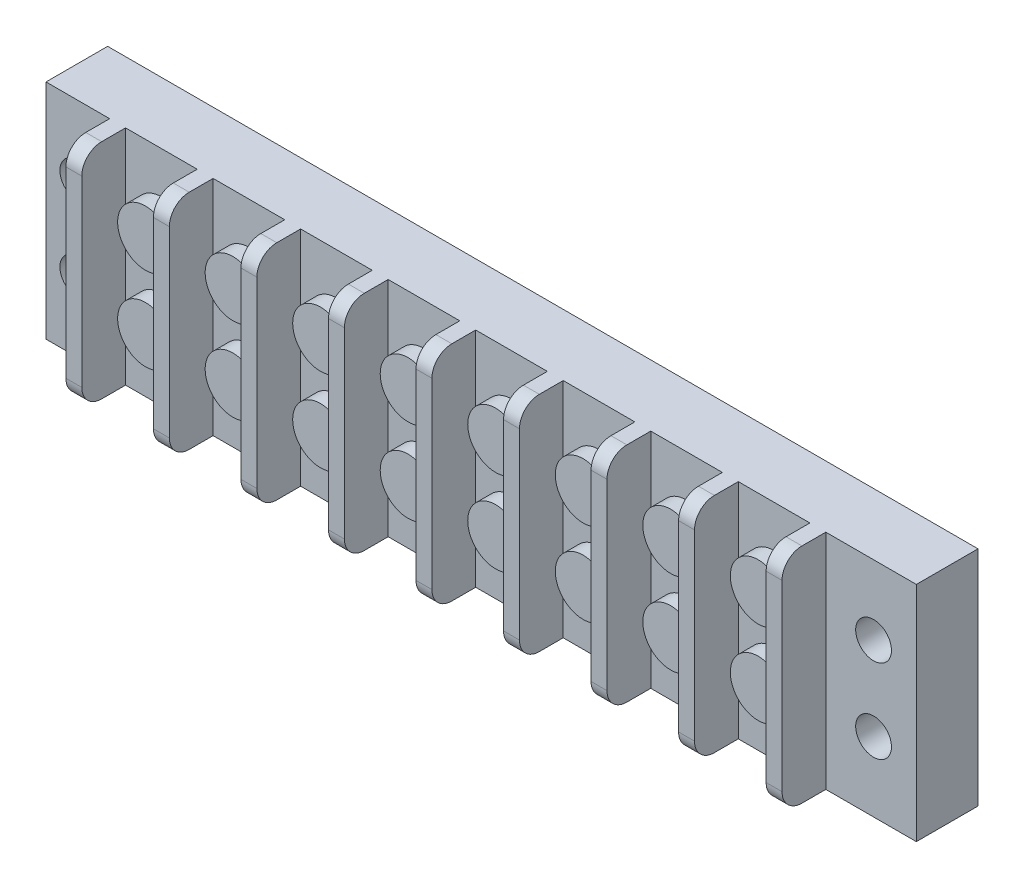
ISO-10303-21;
HEADER;
FILE_DESCRIPTION(('STEP AP214'),'2;1');
FILE_NAME('part.step','',(''),(''),'','','');
FILE_SCHEMA(('AUTOMOTIVE_DESIGN { 1 0 10303 214 1 1 1 1 }'));
ENDSEC;
DATA;
#1=APPLICATION_CONTEXT('core data for automotive mechanical design processes');
#2=APPLICATION_PROTOCOL_DEFINITION('international standard','automotive_design',2000,#1);
#3=PRODUCT_CONTEXT('',#1,'mechanical');
#4=PRODUCT('Part','Part','',(#3));
#5=PRODUCT_RELATED_PRODUCT_CATEGORY('part','',(#4));
#6=PRODUCT_DEFINITION_FORMATION('','',#4);
#7=PRODUCT_DEFINITION_CONTEXT('part definition',#1,'design');
#8=PRODUCT_DEFINITION('design','',#6,#7);
#9=PRODUCT_DEFINITION_SHAPE('','',#8);
#10=(LENGTH_UNIT() NAMED_UNIT(*) SI_UNIT(.MILLI.,.METRE.));
#11=(NAMED_UNIT(*) PLANE_ANGLE_UNIT() SI_UNIT($,.RADIAN.));
#12=(NAMED_UNIT(*) SI_UNIT($,.STERADIAN.) SOLID_ANGLE_UNIT());
#13=UNCERTAINTY_MEASURE_WITH_UNIT(LENGTH_MEASURE(1.E-05),#10,'distance_accuracy_value','');
#14=(GEOMETRIC_REPRESENTATION_CONTEXT(3) GLOBAL_UNCERTAINTY_ASSIGNED_CONTEXT((#13)) GLOBAL_UNIT_ASSIGNED_CONTEXT((#10,
#11,#12)) REPRESENTATION_CONTEXT('',''));
#15=CARTESIAN_POINT('',(0.,0.,0.));
#16=DIRECTION('',(0.,0.,1.));
#17=DIRECTION('',(1.,0.,0.));
#18=AXIS2_PLACEMENT_3D('',#15,#16,#17);
#19=CARTESIAN_POINT('',(0.,0.,7.874));
#20=DIRECTION('',(0.,0.,-1.));
#21=DIRECTION('',(-1.,0.,0.));
#22=AXIS2_PLACEMENT_3D('',#19,#20,#21);
#23=PLANE('',#22);
#24=CARTESIAN_POINT('',(92.964,19.558,7.874));
#25=DIRECTION('',(0.,0.,-1.));
#26=DIRECTION('',(-1.,0.,0.));
#27=AXIS2_PLACEMENT_3D('',#24,#25,#26);
#28=CIRCLE('',#27,3.556);
#29=CARTESIAN_POINT('',(89.408,19.558,7.874));
#30=VERTEX_POINT('',#29);
#31=EDGE_CURVE('E44',#30,#30,#28,.F.);
#32=ORIENTED_EDGE('',*,*,#31,.F.);
#33=EDGE_LOOP('',(#32));
#34=FACE_BOUND('',#33,.T.);
#35=DIRECTION('',(0.,-1.,0.));
#36=VECTOR('',#35,1.);
#37=CARTESIAN_POINT('',(97.536,28.448,7.874));
#38=LINE('',#37,#36);
#39=CARTESIAN_POINT('',(97.536,28.448,7.874));
#40=VERTEX_POINT('',#39);
#41=CARTESIAN_POINT('',(97.536,0.,7.874));
#42=VERTEX_POINT('',#41);
#43=EDGE_CURVE('E420',#40,#42,#38,.T.);
#44=ORIENTED_EDGE('',*,*,#43,.F.);
#45=DIRECTION('',(-1.,0.,0.));
#46=VECTOR('',#45,1.);
#47=CARTESIAN_POINT('',(111.125,28.448,7.874));
#48=LINE('',#47,#46);
#49=CARTESIAN_POINT('',(88.392,28.448,7.874));
#50=VERTEX_POINT('',#49);
#51=EDGE_CURVE('E660',#40,#50,#48,.T.);
#52=ORIENTED_EDGE('',*,*,#51,.T.);
#53=DIRECTION('',(0.,-1.,0.));
#54=VECTOR('',#53,1.);
#55=CARTESIAN_POINT('',(88.392,28.448,7.874));
#56=LINE('',#55,#54);
#57=CARTESIAN_POINT('',(88.392,0.,7.874));
#58=VERTEX_POINT('',#57);
#59=EDGE_CURVE('E423',#50,#58,#56,.T.);
#60=ORIENTED_EDGE('',*,*,#59,.T.);
#61=DIRECTION('',(1.,0.,0.));
#62=VECTOR('',#61,1.);
#63=CARTESIAN_POINT('',(0.,0.,7.874));
#64=LINE('',#63,#62);
#65=EDGE_CURVE('E406',#58,#42,#64,.T.);
#66=ORIENTED_EDGE('',*,*,#65,.T.);
#67=EDGE_LOOP('',(#44,#52,#60,#66));
#68=FACE_BOUND('',#67,.T.);
#69=CARTESIAN_POINT('',(92.964,8.89,7.874));
#70=DIRECTION('',(0.,0.,-1.));
#71=DIRECTION('',(-1.,0.,0.));
#72=AXIS2_PLACEMENT_3D('',#69,#70,#71);
#73=CIRCLE('',#72,3.556);
#74=CARTESIAN_POINT('',(89.408,8.89,7.874));
#75=VERTEX_POINT('',#74);
#76=EDGE_CURVE('E11',#75,#75,#73,.F.);
#77=ORIENTED_EDGE('',*,*,#76,.F.);
#78=EDGE_LOOP('',(#77));
#79=FACE_BOUND('',#78,.T.);
#80=ADVANCED_FACE('F36',(#34,#68,#79),#23,.F.);
#81=CARTESIAN_POINT('',(81.788,19.558,7.874));
#82=DIRECTION('',(0.,0.,-1.));
#83=DIRECTION('',(-1.,0.,0.));
#84=AXIS2_PLACEMENT_3D('',#81,#82,#83);
#85=CIRCLE('',#84,3.556);
#86=CARTESIAN_POINT('',(78.232,19.558,7.874));
#87=VERTEX_POINT('',#86);
#88=EDGE_CURVE('E775',#87,#87,#85,.F.);
#89=ORIENTED_EDGE('',*,*,#88,.F.);
#90=EDGE_LOOP('',(#89));
#91=FACE_BOUND('',#90,.T.);
#92=DIRECTION('',(0.,-1.,0.));
#93=VECTOR('',#92,1.);
#94=CARTESIAN_POINT('',(86.36,28.448,7.874));
#95=LINE('',#94,#93);
#96=CARTESIAN_POINT('',(86.36,28.448,7.874));
#97=VERTEX_POINT('',#96);
#98=CARTESIAN_POINT('',(86.36,0.,7.874));
#99=VERTEX_POINT('',#98);
#100=EDGE_CURVE('E447',#97,#99,#95,.T.);
#101=ORIENTED_EDGE('',*,*,#100,.F.);
#102=CARTESIAN_POINT('',(77.216,28.448,7.874));
#103=VERTEX_POINT('',#102);
#104=EDGE_CURVE('E658',#97,#103,#48,.T.);
#105=ORIENTED_EDGE('',*,*,#104,.T.);
#106=DIRECTION('',(0.,-1.,0.));
#107=VECTOR('',#106,1.);
#108=CARTESIAN_POINT('',(77.216,28.448,7.874));
#109=LINE('',#108,#107);
#110=CARTESIAN_POINT('',(77.216,0.,7.874));
#111=VERTEX_POINT('',#110);
#112=EDGE_CURVE('E461',#103,#111,#109,.T.);
#113=ORIENTED_EDGE('',*,*,#112,.T.);
#114=EDGE_CURVE('E424',#111,#99,#64,.T.);
#115=ORIENTED_EDGE('',*,*,#114,.T.);
#116=EDGE_LOOP('',(#101,#105,#113,#115));
#117=FACE_BOUND('',#116,.T.);
#118=CARTESIAN_POINT('',(81.788,8.89,7.874));
#119=DIRECTION('',(0.,0.,-1.));
#120=DIRECTION('',(-1.,0.,0.));
#121=AXIS2_PLACEMENT_3D('',#118,#119,#120);
#122=CIRCLE('',#121,3.556);
#123=CARTESIAN_POINT('',(78.232,8.89,7.874));
#124=VERTEX_POINT('',#123);
#125=EDGE_CURVE('E778',#124,#124,#122,.F.);
#126=ORIENTED_EDGE('',*,*,#125,.F.);
#127=EDGE_LOOP('',(#126));
#128=FACE_BOUND('',#127,.T.);
#129=ADVANCED_FACE('F692',(#91,#117,#128),#23,.F.);
#130=CARTESIAN_POINT('',(70.612,19.558,7.874));
#131=DIRECTION('',(0.,0.,-1.));
#132=DIRECTION('',(-1.,0.,0.));
#133=AXIS2_PLACEMENT_3D('',#130,#131,#132);
#134=CIRCLE('',#133,3.556);
#135=CARTESIAN_POINT('',(67.056,19.558,7.874));
#136=VERTEX_POINT('',#135);
#137=EDGE_CURVE('E769',#136,#136,#134,.F.);
#138=ORIENTED_EDGE('',*,*,#137,.F.);
#139=EDGE_LOOP('',(#138));
#140=FACE_BOUND('',#139,.T.);
#141=DIRECTION('',(0.,-1.,0.));
#142=VECTOR('',#141,1.);
#143=CARTESIAN_POINT('',(75.184,28.448,7.874));
#144=LINE('',#143,#142);
#145=CARTESIAN_POINT('',(75.184,28.448,7.874));
#146=VERTEX_POINT('',#145);
#147=CARTESIAN_POINT('',(75.184,0.,7.874));
#148=VERTEX_POINT('',#147);
#149=EDGE_CURVE('E466',#146,#148,#144,.T.);
#150=ORIENTED_EDGE('',*,*,#149,.F.);
#151=CARTESIAN_POINT('',(66.04,28.448,7.874));
#152=VERTEX_POINT('',#151);
#153=EDGE_CURVE('E655',#146,#152,#48,.T.);
#154=ORIENTED_EDGE('',*,*,#153,.T.);
#155=DIRECTION('',(0.,-1.,0.));
#156=VECTOR('',#155,1.);
#157=CARTESIAN_POINT('',(66.04,28.448,7.874));
#158=LINE('',#157,#156);
#159=CARTESIAN_POINT('',(66.04,0.,7.874));
#160=VERTEX_POINT('',#159);
#161=EDGE_CURVE('E481',#152,#160,#158,.T.);
#162=ORIENTED_EDGE('',*,*,#161,.T.);
#163=EDGE_CURVE('E682',#160,#148,#64,.T.);
#164=ORIENTED_EDGE('',*,*,#163,.T.);
#165=EDGE_LOOP('',(#150,#154,#162,#164));
#166=FACE_BOUND('',#165,.T.);
#167=CARTESIAN_POINT('',(70.612,8.89,7.874));
#168=DIRECTION('',(0.,0.,-1.));
#169=DIRECTION('',(-1.,0.,0.));
#170=AXIS2_PLACEMENT_3D('',#167,#168,#169);
#171=CIRCLE('',#170,3.556);
#172=CARTESIAN_POINT('',(67.056,8.89,7.874));
#173=VERTEX_POINT('',#172);
#174=EDGE_CURVE('E772',#173,#173,#171,.F.);
#175=ORIENTED_EDGE('',*,*,#174,.F.);
#176=EDGE_LOOP('',(#175));
#177=FACE_BOUND('',#176,.T.);
#178=ADVANCED_FACE('F791',(#140,#166,#177),#23,.F.);
#179=CARTESIAN_POINT('',(59.436,19.558,7.874));
#180=DIRECTION('',(0.,0.,-1.));
#181=DIRECTION('',(-1.,0.,0.));
#182=AXIS2_PLACEMENT_3D('',#179,#180,#181);
#183=CIRCLE('',#182,3.556);
#184=CARTESIAN_POINT('',(55.88,19.558,7.874));
#185=VERTEX_POINT('',#184);
#186=EDGE_CURVE('E763',#185,#185,#183,.F.);
#187=ORIENTED_EDGE('',*,*,#186,.F.);
#188=EDGE_LOOP('',(#187));
#189=FACE_BOUND('',#188,.T.);
#190=DIRECTION('',(0.,-1.,0.));
#191=VECTOR('',#190,1.);
#192=CARTESIAN_POINT('',(64.008,28.448,7.874));
#193=LINE('',#192,#191);
#194=CARTESIAN_POINT('',(64.008,28.448,7.874));
#195=VERTEX_POINT('',#194);
#196=CARTESIAN_POINT('',(64.008,0.,7.874));
#197=VERTEX_POINT('',#196);
#198=EDGE_CURVE('E486',#195,#197,#193,.T.);
#199=ORIENTED_EDGE('',*,*,#198,.F.);
#200=CARTESIAN_POINT('',(54.864,28.448,7.874));
#201=VERTEX_POINT('',#200);
#202=EDGE_CURVE('E652',#195,#201,#48,.T.);
#203=ORIENTED_EDGE('',*,*,#202,.T.);
#204=DIRECTION('',(0.,-1.,0.));
#205=VECTOR('',#204,1.);
#206=CARTESIAN_POINT('',(54.864,28.448,7.874));
#207=LINE('',#206,#205);
#208=CARTESIAN_POINT('',(54.864,0.,7.874));
#209=VERTEX_POINT('',#208);
#210=EDGE_CURVE('E501',#201,#209,#207,.T.);
#211=ORIENTED_EDGE('',*,*,#210,.T.);
#212=EDGE_CURVE('E680',#209,#197,#64,.T.);
#213=ORIENTED_EDGE('',*,*,#212,.T.);
#214=EDGE_LOOP('',(#199,#203,#211,#213));
#215=FACE_BOUND('',#214,.T.);
#216=CARTESIAN_POINT('',(59.436,8.89,7.874));
#217=DIRECTION('',(0.,0.,-1.));
#218=DIRECTION('',(-1.,0.,0.));
#219=AXIS2_PLACEMENT_3D('',#216,#217,#218);
#220=CIRCLE('',#219,3.556);
#221=CARTESIAN_POINT('',(55.88,8.89,7.874));
#222=VERTEX_POINT('',#221);
#223=EDGE_CURVE('E766',#222,#222,#220,.F.);
#224=ORIENTED_EDGE('',*,*,#223,.F.);
#225=EDGE_LOOP('',(#224));
#226=FACE_BOUND('',#225,.T.);
#227=ADVANCED_FACE('F1039',(#189,#215,#226),#23,.F.);
#228=CARTESIAN_POINT('',(48.26,19.558,7.874));
#229=DIRECTION('',(0.,0.,-1.));
#230=DIRECTION('',(-1.,0.,0.));
#231=AXIS2_PLACEMENT_3D('',#228,#229,#230);
#232=CIRCLE('',#231,3.556);
#233=CARTESIAN_POINT('',(44.704,19.558,7.874));
#234=VERTEX_POINT('',#233);
#235=EDGE_CURVE('E757',#234,#234,#232,.F.);
#236=ORIENTED_EDGE('',*,*,#235,.F.);
#237=EDGE_LOOP('',(#236));
#238=FACE_BOUND('',#237,.T.);
#239=DIRECTION('',(0.,-1.,0.));
#240=VECTOR('',#239,1.);
#241=CARTESIAN_POINT('',(52.832,28.448,7.874));
#242=LINE('',#241,#240);
#243=CARTESIAN_POINT('',(52.832,28.448,7.874));
#244=VERTEX_POINT('',#243);
#245=CARTESIAN_POINT('',(52.832,0.,7.874));
#246=VERTEX_POINT('',#245);
#247=EDGE_CURVE('E506',#244,#246,#242,.T.);
#248=ORIENTED_EDGE('',*,*,#247,.F.);
#249=CARTESIAN_POINT('',(43.688,28.448,7.874));
#250=VERTEX_POINT('',#249);
#251=EDGE_CURVE('E648',#244,#250,#48,.T.);
#252=ORIENTED_EDGE('',*,*,#251,.T.);
#253=DIRECTION('',(0.,-1.,0.));
#254=VECTOR('',#253,1.);
#255=CARTESIAN_POINT('',(43.688,28.448,7.874));
#256=LINE('',#255,#254);
#257=CARTESIAN_POINT('',(43.688,0.,7.874));
#258=VERTEX_POINT('',#257);
#259=EDGE_CURVE('E521',#250,#258,#256,.T.);
#260=ORIENTED_EDGE('',*,*,#259,.T.);
#261=EDGE_CURVE('E678',#258,#246,#64,.T.);
#262=ORIENTED_EDGE('',*,*,#261,.T.);
#263=EDGE_LOOP('',(#248,#252,#260,#262));
#264=FACE_BOUND('',#263,.T.);
#265=CARTESIAN_POINT('',(48.26,8.89,7.874));
#266=DIRECTION('',(0.,0.,-1.));
#267=DIRECTION('',(-1.,0.,0.));
#268=AXIS2_PLACEMENT_3D('',#265,#266,#267);
#269=CIRCLE('',#268,3.556);
#270=CARTESIAN_POINT('',(44.704,8.89,7.874));
#271=VERTEX_POINT('',#270);
#272=EDGE_CURVE('E760',#271,#271,#269,.F.);
#273=ORIENTED_EDGE('',*,*,#272,.F.);
#274=EDGE_LOOP('',(#273));
#275=FACE_BOUND('',#274,.T.);
#276=ADVANCED_FACE('F877',(#238,#264,#275),#23,.F.);
#277=CARTESIAN_POINT('',(37.084,19.558,7.874));
#278=DIRECTION('',(0.,0.,-1.));
#279=DIRECTION('',(-1.,0.,0.));
#280=AXIS2_PLACEMENT_3D('',#277,#278,#279);
#281=CIRCLE('',#280,3.556);
#282=CARTESIAN_POINT('',(33.528,19.558,7.874));
#283=VERTEX_POINT('',#282);
#284=EDGE_CURVE('E751',#283,#283,#281,.F.);
#285=ORIENTED_EDGE('',*,*,#284,.F.);
#286=EDGE_LOOP('',(#285));
#287=FACE_BOUND('',#286,.T.);
#288=DIRECTION('',(0.,-1.,0.));
#289=VECTOR('',#288,1.);
#290=CARTESIAN_POINT('',(41.656,28.448,7.874));
#291=LINE('',#290,#289);
#292=CARTESIAN_POINT('',(41.656,28.448,7.874));
#293=VERTEX_POINT('',#292);
#294=CARTESIAN_POINT('',(41.656,0.,7.874));
#295=VERTEX_POINT('',#294);
#296=EDGE_CURVE('E526',#293,#295,#291,.T.);
#297=ORIENTED_EDGE('',*,*,#296,.F.);
#298=CARTESIAN_POINT('',(32.512,28.448,7.874));
#299=VERTEX_POINT('',#298);
#300=EDGE_CURVE('E644',#293,#299,#48,.T.);
#301=ORIENTED_EDGE('',*,*,#300,.T.);
#302=DIRECTION('',(0.,-1.,0.));
#303=VECTOR('',#302,1.);
#304=CARTESIAN_POINT('',(32.512,28.448,7.874));
#305=LINE('',#304,#303);
#306=CARTESIAN_POINT('',(32.512,0.,7.874));
#307=VERTEX_POINT('',#306);
#308=EDGE_CURVE('E541',#299,#307,#305,.T.);
#309=ORIENTED_EDGE('',*,*,#308,.T.);
#310=EDGE_CURVE('E676',#307,#295,#64,.T.);
#311=ORIENTED_EDGE('',*,*,#310,.T.);
#312=EDGE_LOOP('',(#297,#301,#309,#311));
#313=FACE_BOUND('',#312,.T.);
#314=CARTESIAN_POINT('',(37.084,8.89,7.874));
#315=DIRECTION('',(0.,0.,-1.));
#316=DIRECTION('',(-1.,0.,0.));
#317=AXIS2_PLACEMENT_3D('',#314,#315,#316);
#318=CIRCLE('',#317,3.556);
#319=CARTESIAN_POINT('',(33.528,8.89,7.874));
#320=VERTEX_POINT('',#319);
#321=EDGE_CURVE('E754',#320,#320,#318,.F.);
#322=ORIENTED_EDGE('',*,*,#321,.F.);
#323=EDGE_LOOP('',(#322));
#324=FACE_BOUND('',#323,.T.);
#325=ADVANCED_FACE('F1723',(#287,#313,#324),#23,.F.);
#326=CARTESIAN_POINT('',(25.908,19.558,7.874));
#327=DIRECTION('',(0.,0.,-1.));
#328=DIRECTION('',(-1.,0.,0.));
#329=AXIS2_PLACEMENT_3D('',#326,#327,#328);
#330=CIRCLE('',#329,3.556);
#331=CARTESIAN_POINT('',(22.352,19.558,7.874));
#332=VERTEX_POINT('',#331);
#333=EDGE_CURVE('E745',#332,#332,#330,.F.);
#334=ORIENTED_EDGE('',*,*,#333,.F.);
#335=EDGE_LOOP('',(#334));
#336=FACE_BOUND('',#335,.T.);
#337=DIRECTION('',(0.,-1.,0.));
#338=VECTOR('',#337,1.);
#339=CARTESIAN_POINT('',(30.48,28.448,7.874));
#340=LINE('',#339,#338);
#341=CARTESIAN_POINT('',(30.48,28.448,7.874));
#342=VERTEX_POINT('',#341);
#343=CARTESIAN_POINT('',(30.48,0.,7.874));
#344=VERTEX_POINT('',#343);
#345=EDGE_CURVE('E546',#342,#344,#340,.T.);
#346=ORIENTED_EDGE('',*,*,#345,.F.);
#347=CARTESIAN_POINT('',(21.336,28.448,7.874));
#348=VERTEX_POINT('',#347);
#349=EDGE_CURVE('E622',#342,#348,#48,.T.);
#350=ORIENTED_EDGE('',*,*,#349,.T.);
#351=DIRECTION('',(0.,-1.,0.));
#352=VECTOR('',#351,1.);
#353=CARTESIAN_POINT('',(21.336,28.448,7.874));
#354=LINE('',#353,#352);
#355=CARTESIAN_POINT('',(21.336,0.,7.874));
#356=VERTEX_POINT('',#355);
#357=EDGE_CURVE('E561',#348,#356,#354,.T.);
#358=ORIENTED_EDGE('',*,*,#357,.T.);
#359=EDGE_CURVE('E623',#356,#344,#64,.T.);
#360=ORIENTED_EDGE('',*,*,#359,.T.);
#361=EDGE_LOOP('',(#346,#350,#358,#360));
#362=FACE_BOUND('',#361,.T.);
#363=CARTESIAN_POINT('',(25.908,8.89,7.874));
#364=DIRECTION('',(0.,0.,-1.));
#365=DIRECTION('',(-1.,0.,0.));
#366=AXIS2_PLACEMENT_3D('',#363,#364,#365);
#367=CIRCLE('',#366,3.556);
#368=CARTESIAN_POINT('',(22.352,8.89,7.874));
#369=VERTEX_POINT('',#368);
#370=EDGE_CURVE('E748',#369,#369,#367,.F.);
#371=ORIENTED_EDGE('',*,*,#370,.F.);
#372=EDGE_LOOP('',(#371));
#373=FACE_BOUND('',#372,.T.);
#374=ADVANCED_FACE('F819',(#336,#362,#373),#23,.F.);
#375=CARTESIAN_POINT('',(14.732,19.558,7.874));
#376=DIRECTION('',(0.,0.,-1.));
#377=DIRECTION('',(-1.,0.,0.));
#378=AXIS2_PLACEMENT_3D('',#375,#376,#377);
#379=CIRCLE('',#378,3.556);
#380=CARTESIAN_POINT('',(11.176,19.558,7.874));
#381=VERTEX_POINT('',#380);
#382=EDGE_CURVE('E739',#381,#381,#379,.F.);
#383=ORIENTED_EDGE('',*,*,#382,.F.);
#384=EDGE_LOOP('',(#383));
#385=FACE_BOUND('',#384,.T.);
#386=DIRECTION('',(0.,-1.,0.));
#387=VECTOR('',#386,1.);
#388=CARTESIAN_POINT('',(19.304,28.448,7.874));
#389=LINE('',#388,#387);
#390=CARTESIAN_POINT('',(19.304,28.448,7.874));
#391=VERTEX_POINT('',#390);
#392=CARTESIAN_POINT('',(19.304,0.,7.874));
#393=VERTEX_POINT('',#392);
#394=EDGE_CURVE('E566',#391,#393,#389,.T.);
#395=ORIENTED_EDGE('',*,*,#394,.F.);
#396=CARTESIAN_POINT('',(10.16,28.448,7.874));
#397=VERTEX_POINT('',#396);
#398=EDGE_CURVE('E620',#391,#397,#48,.T.);
#399=ORIENTED_EDGE('',*,*,#398,.T.);
#400=DIRECTION('',(0.,-1.,0.));
#401=VECTOR('',#400,1.);
#402=CARTESIAN_POINT('',(10.16,28.448,7.874));
#403=LINE('',#402,#401);
#404=CARTESIAN_POINT('',(10.16,0.,7.874));
#405=VERTEX_POINT('',#404);
#406=EDGE_CURVE('E581',#397,#405,#403,.T.);
#407=ORIENTED_EDGE('',*,*,#406,.T.);
#408=EDGE_CURVE('E668',#405,#393,#64,.T.);
#409=ORIENTED_EDGE('',*,*,#408,.T.);
#410=EDGE_LOOP('',(#395,#399,#407,#409));
#411=FACE_BOUND('',#410,.T.);
#412=CARTESIAN_POINT('',(14.732,8.89,7.874));
#413=DIRECTION('',(0.,0.,-1.));
#414=DIRECTION('',(-1.,0.,0.));
#415=AXIS2_PLACEMENT_3D('',#412,#413,#414);
#416=CIRCLE('',#415,3.556);
#417=CARTESIAN_POINT('',(11.176,8.89,7.874));
#418=VERTEX_POINT('',#417);
#419=EDGE_CURVE('E742',#418,#418,#416,.F.);
#420=ORIENTED_EDGE('',*,*,#419,.F.);
#421=EDGE_LOOP('',(#420));
#422=FACE_BOUND('',#421,.T.);
#423=ADVANCED_FACE('F811',(#385,#411,#422),#23,.F.);
#424=CARTESIAN_POINT('',(4.064,8.88999999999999,7.874));
#425=DIRECTION('',(0.,0.,1.));
#426=DIRECTION('',(1.,0.,0.));
#427=AXIS2_PLACEMENT_3D('',#424,#425,#426);
#428=CIRCLE('',#427,2.286);
#429=CARTESIAN_POINT('',(6.35,8.88999999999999,7.874));
#430=VERTEX_POINT('',#429);
#431=EDGE_CURVE('E609',#430,#430,#428,.T.);
#432=ORIENTED_EDGE('',*,*,#431,.F.);
#433=EDGE_LOOP('',(#432));
#434=FACE_BOUND('',#433,.T.);
#435=CARTESIAN_POINT('',(4.064,19.558,7.874));
#436=DIRECTION('',(0.,0.,1.));
#437=DIRECTION('',(1.,0.,0.));
#438=AXIS2_PLACEMENT_3D('',#435,#436,#437);
#439=CIRCLE('',#438,2.286);
#440=CARTESIAN_POINT('',(6.35,19.558,7.874));
#441=VERTEX_POINT('',#440);
#442=EDGE_CURVE('E827',#441,#441,#439,.T.);
#443=ORIENTED_EDGE('',*,*,#442,.F.);
#444=EDGE_LOOP('',(#443));
#445=FACE_BOUND('',#444,.T.);
#446=DIRECTION('',(0.,-1.,0.));
#447=VECTOR('',#446,1.);
#448=CARTESIAN_POINT('',(8.128,28.448,7.874));
#449=LINE('',#448,#447);
#450=CARTESIAN_POINT('',(8.128,28.448,7.874));
#451=VERTEX_POINT('',#450);
#452=CARTESIAN_POINT('',(8.128,0.,7.874));
#453=VERTEX_POINT('',#452);
#454=EDGE_CURVE('E586',#451,#453,#449,.T.);
#455=ORIENTED_EDGE('',*,*,#454,.F.);
#456=CARTESIAN_POINT('',(0.,28.448,7.874));
#457=VERTEX_POINT('',#456);
#458=EDGE_CURVE('E598',#451,#457,#48,.T.);
#459=ORIENTED_EDGE('',*,*,#458,.T.);
#460=DIRECTION('',(0.,1.,0.));
#461=VECTOR('',#460,1.);
#462=CARTESIAN_POINT('',(0.,0.,7.874));
#463=LINE('',#462,#461);
#464=CARTESIAN_POINT('',(0.,0.,7.874));
#465=VERTEX_POINT('',#464);
#466=EDGE_CURVE('E629',#465,#457,#463,.T.);
#467=ORIENTED_EDGE('',*,*,#466,.F.);
#468=EDGE_CURVE('E672',#465,#453,#64,.T.);
#469=ORIENTED_EDGE('',*,*,#468,.T.);
#470=EDGE_LOOP('',(#455,#459,#467,#469));
#471=FACE_BOUND('',#470,.T.);
#472=ADVANCED_FACE('F798',(#434,#445,#471),#23,.F.);
#473=CARTESIAN_POINT('',(0.,0.,7.874));
#474=DIRECTION('',(-1.,0.,0.));
#475=DIRECTION('',(0.,0.,1.));
#476=AXIS2_PLACEMENT_3D('',#473,#474,#475);
#477=PLANE('',#476);
#478=DIRECTION('',(0.,1.,0.));
#479=VECTOR('',#478,1.);
#480=CARTESIAN_POINT('',(0.,0.,0.));
#481=LINE('',#480,#479);
#482=CARTESIAN_POINT('',(0.,0.,0.));
#483=VERTEX_POINT('',#482);
#484=CARTESIAN_POINT('',(0.,28.448,0.));
#485=VERTEX_POINT('',#484);
#486=EDGE_CURVE('E664',#483,#485,#481,.T.);
#487=ORIENTED_EDGE('',*,*,#486,.F.);
#488=DIRECTION('',(0.,0.,-1.));
#489=VECTOR('',#488,1.);
#490=CARTESIAN_POINT('',(0.,0.,7.874));
#491=LINE('',#490,#489);
#492=EDGE_CURVE('E854',#465,#483,#491,.T.);
#493=ORIENTED_EDGE('',*,*,#492,.F.);
#494=ORIENTED_EDGE('',*,*,#466,.T.);
#495=DIRECTION('',(0.,0.,-1.));
#496=VECTOR('',#495,1.);
#497=CARTESIAN_POINT('',(0.,28.448,7.874));
#498=LINE('',#497,#496);
#499=EDGE_CURVE('E842',#457,#485,#498,.T.);
#500=ORIENTED_EDGE('',*,*,#499,.T.);
#501=EDGE_LOOP('',(#487,#493,#494,#500));
#502=FACE_BOUND('',#501,.T.);
#503=ADVANCED_FACE('F810',(#502),#477,.T.);
#504=CARTESIAN_POINT('',(0.,0.,7.874));
#505=DIRECTION('',(0.,1.,0.));
#506=DIRECTION('',(0.,0.,1.));
#507=AXIS2_PLACEMENT_3D('',#504,#505,#506);
#508=PLANE('',#507);
#509=DIRECTION('',(0.,0.,-1.));
#510=VECTOR('',#509,1.);
#511=CARTESIAN_POINT('',(99.568,0.,13.462));
#512=LINE('',#511,#510);
#513=CARTESIAN_POINT('',(99.568,0.,10.922));
#514=VERTEX_POINT('',#513);
#515=CARTESIAN_POINT('',(99.568,0.,7.874));
#516=VERTEX_POINT('',#515);
#517=EDGE_CURVE('E441',#514,#516,#512,.T.);
#518=ORIENTED_EDGE('',*,*,#517,.F.);
#519=DIRECTION('',(1.,0.,0.));
#520=VECTOR('',#519,1.);
#521=CARTESIAN_POINT('',(0.,0.,10.922));
#522=LINE('',#521,#520);
#523=CARTESIAN_POINT('',(97.536,0.,10.922));
#524=VERTEX_POINT('',#523);
#525=EDGE_CURVE('E408',#514,#524,#522,.F.);
#526=ORIENTED_EDGE('',*,*,#525,.T.);
#527=DIRECTION('',(0.,0.,-1.));
#528=VECTOR('',#527,1.);
#529=CARTESIAN_POINT('',(97.536,0.,13.462));
#530=LINE('',#529,#528);
#531=EDGE_CURVE('E402',#524,#42,#530,.T.);
#532=ORIENTED_EDGE('',*,*,#531,.T.);
#533=ORIENTED_EDGE('',*,*,#65,.F.);
#534=DIRECTION('',(0.,0.,-1.));
#535=VECTOR('',#534,1.);
#536=CARTESIAN_POINT('',(88.392,0.,13.462));
#537=LINE('',#536,#535);
#538=CARTESIAN_POINT('',(88.392,0.,10.922));
#539=VERTEX_POINT('',#538);
#540=EDGE_CURVE('E459',#539,#58,#537,.T.);
#541=ORIENTED_EDGE('',*,*,#540,.F.);
#542=DIRECTION('',(1.,0.,0.));
#543=VECTOR('',#542,1.);
#544=CARTESIAN_POINT('',(0.,0.,10.922));
#545=LINE('',#544,#543);
#546=CARTESIAN_POINT('',(86.36,0.,10.922));
#547=VERTEX_POINT('',#546);
#548=EDGE_CURVE('E722',#539,#547,#545,.F.);
#549=ORIENTED_EDGE('',*,*,#548,.T.);
#550=DIRECTION('',(0.,0.,-1.));
#551=VECTOR('',#550,1.);
#552=CARTESIAN_POINT('',(86.36,0.,13.462));
#553=LINE('',#552,#551);
#554=EDGE_CURVE('E450',#547,#99,#553,.T.);
#555=ORIENTED_EDGE('',*,*,#554,.T.);
#556=ORIENTED_EDGE('',*,*,#114,.F.);
#557=DIRECTION('',(0.,0.,-1.));
#558=VECTOR('',#557,1.);
#559=CARTESIAN_POINT('',(77.216,0.,13.462));
#560=LINE('',#559,#558);
#561=CARTESIAN_POINT('',(77.216,0.,10.922));
#562=VERTEX_POINT('',#561);
#563=EDGE_CURVE('E479',#562,#111,#560,.T.);
#564=ORIENTED_EDGE('',*,*,#563,.F.);
#565=DIRECTION('',(1.,0.,0.));
#566=VECTOR('',#565,1.);
#567=CARTESIAN_POINT('',(0.,0.,10.922));
#568=LINE('',#567,#566);
#569=CARTESIAN_POINT('',(75.184,0.,10.922));
#570=VERTEX_POINT('',#569);
#571=EDGE_CURVE('E943',#562,#570,#568,.F.);
#572=ORIENTED_EDGE('',*,*,#571,.T.);
#573=DIRECTION('',(0.,0.,-1.));
#574=VECTOR('',#573,1.);
#575=CARTESIAN_POINT('',(75.184,0.,13.462));
#576=LINE('',#575,#574);
#577=EDGE_CURVE('E469',#570,#148,#576,.T.);
#578=ORIENTED_EDGE('',*,*,#577,.T.);
#579=ORIENTED_EDGE('',*,*,#163,.F.);
#580=DIRECTION('',(0.,0.,-1.));
#581=VECTOR('',#580,1.);
#582=CARTESIAN_POINT('',(66.04,0.,13.462));
#583=LINE('',#582,#581);
#584=CARTESIAN_POINT('',(66.04,0.,10.922));
#585=VERTEX_POINT('',#584);
#586=EDGE_CURVE('E499',#585,#160,#583,.T.);
#587=ORIENTED_EDGE('',*,*,#586,.F.);
#588=DIRECTION('',(1.,0.,0.));
#589=VECTOR('',#588,1.);
#590=CARTESIAN_POINT('',(0.,0.,10.922));
#591=LINE('',#590,#589);
#592=CARTESIAN_POINT('',(64.008,0.,10.922));
#593=VERTEX_POINT('',#592);
#594=EDGE_CURVE('E925',#585,#593,#591,.F.);
#595=ORIENTED_EDGE('',*,*,#594,.T.);
#596=DIRECTION('',(0.,0.,-1.));
#597=VECTOR('',#596,1.);
#598=CARTESIAN_POINT('',(64.008,0.,13.462));
#599=LINE('',#598,#597);
#600=EDGE_CURVE('E489',#593,#197,#599,.T.);
#601=ORIENTED_EDGE('',*,*,#600,.T.);
#602=ORIENTED_EDGE('',*,*,#212,.F.);
#603=DIRECTION('',(0.,0.,-1.));
#604=VECTOR('',#603,1.);
#605=CARTESIAN_POINT('',(54.864,0.,13.462));
#606=LINE('',#605,#604);
#607=CARTESIAN_POINT('',(54.864,0.,10.922));
#608=VERTEX_POINT('',#607);
#609=EDGE_CURVE('E519',#608,#209,#606,.T.);
#610=ORIENTED_EDGE('',*,*,#609,.F.);
#611=DIRECTION('',(1.,0.,0.));
#612=VECTOR('',#611,1.);
#613=CARTESIAN_POINT('',(0.,0.,10.922));
#614=LINE('',#613,#612);
#615=CARTESIAN_POINT('',(52.832,0.,10.922));
#616=VERTEX_POINT('',#615);
#617=EDGE_CURVE('E907',#608,#616,#614,.F.);
#618=ORIENTED_EDGE('',*,*,#617,.T.);
#619=DIRECTION('',(0.,0.,-1.));
#620=VECTOR('',#619,1.);
#621=CARTESIAN_POINT('',(52.832,0.,13.462));
#622=LINE('',#621,#620);
#623=EDGE_CURVE('E509',#616,#246,#622,.T.);
#624=ORIENTED_EDGE('',*,*,#623,.T.);
#625=ORIENTED_EDGE('',*,*,#261,.F.);
#626=DIRECTION('',(0.,0.,-1.));
#627=VECTOR('',#626,1.);
#628=CARTESIAN_POINT('',(43.688,0.,13.462));
#629=LINE('',#628,#627);
#630=CARTESIAN_POINT('',(43.688,0.,10.922));
#631=VERTEX_POINT('',#630);
#632=EDGE_CURVE('E539',#631,#258,#629,.T.);
#633=ORIENTED_EDGE('',*,*,#632,.F.);
#634=DIRECTION('',(1.,0.,0.));
#635=VECTOR('',#634,1.);
#636=CARTESIAN_POINT('',(0.,0.,10.922));
#637=LINE('',#636,#635);
#638=CARTESIAN_POINT('',(41.656,0.,10.922));
#639=VERTEX_POINT('',#638);
#640=EDGE_CURVE('E1018',#631,#639,#637,.F.);
#641=ORIENTED_EDGE('',*,*,#640,.T.);
#642=DIRECTION('',(0.,0.,-1.));
#643=VECTOR('',#642,1.);
#644=CARTESIAN_POINT('',(41.656,0.,13.462));
#645=LINE('',#644,#643);
#646=EDGE_CURVE('E529',#639,#295,#645,.T.);
#647=ORIENTED_EDGE('',*,*,#646,.T.);
#648=ORIENTED_EDGE('',*,*,#310,.F.);
#649=DIRECTION('',(0.,0.,-1.));
#650=VECTOR('',#649,1.);
#651=CARTESIAN_POINT('',(32.512,0.,13.462));
#652=LINE('',#651,#650);
#653=CARTESIAN_POINT('',(32.512,0.,10.922));
#654=VERTEX_POINT('',#653);
#655=EDGE_CURVE('E559',#654,#307,#652,.T.);
#656=ORIENTED_EDGE('',*,*,#655,.F.);
#657=DIRECTION('',(1.,0.,0.));
#658=VECTOR('',#657,1.);
#659=CARTESIAN_POINT('',(0.,0.,10.922));
#660=LINE('',#659,#658);
#661=CARTESIAN_POINT('',(30.48,0.,10.922));
#662=VERTEX_POINT('',#661);
#663=EDGE_CURVE('E1000',#654,#662,#660,.F.);
#664=ORIENTED_EDGE('',*,*,#663,.T.);
#665=DIRECTION('',(0.,0.,-1.));
#666=VECTOR('',#665,1.);
#667=CARTESIAN_POINT('',(30.48,0.,13.462));
#668=LINE('',#667,#666);
#669=EDGE_CURVE('E549',#662,#344,#668,.T.);
#670=ORIENTED_EDGE('',*,*,#669,.T.);
#671=ORIENTED_EDGE('',*,*,#359,.F.);
#672=DIRECTION('',(0.,0.,-1.));
#673=VECTOR('',#672,1.);
#674=CARTESIAN_POINT('',(21.336,0.,13.462));
#675=LINE('',#674,#673);
#676=CARTESIAN_POINT('',(21.336,0.,10.922));
#677=VERTEX_POINT('',#676);
#678=EDGE_CURVE('E579',#677,#356,#675,.T.);
#679=ORIENTED_EDGE('',*,*,#678,.F.);
#680=DIRECTION('',(1.,0.,0.));
#681=VECTOR('',#680,1.);
#682=CARTESIAN_POINT('',(0.,0.,10.922));
#683=LINE('',#682,#681);
#684=CARTESIAN_POINT('',(19.304,0.,10.922));
#685=VERTEX_POINT('',#684);
#686=EDGE_CURVE('E982',#677,#685,#683,.F.);
#687=ORIENTED_EDGE('',*,*,#686,.T.);
#688=DIRECTION('',(0.,0.,-1.));
#689=VECTOR('',#688,1.);
#690=CARTESIAN_POINT('',(19.304,0.,13.462));
#691=LINE('',#690,#689);
#692=EDGE_CURVE('E569',#685,#393,#691,.T.);
#693=ORIENTED_EDGE('',*,*,#692,.T.);
#694=ORIENTED_EDGE('',*,*,#408,.F.);
#695=DIRECTION('',(0.,0.,-1.));
#696=VECTOR('',#695,1.);
#697=CARTESIAN_POINT('',(10.16,0.,13.462));
#698=LINE('',#697,#696);
#699=CARTESIAN_POINT('',(10.16,0.,10.922));
#700=VERTEX_POINT('',#699);
#701=EDGE_CURVE('E606',#700,#405,#698,.T.);
#702=ORIENTED_EDGE('',*,*,#701,.F.);
#703=DIRECTION('',(1.,0.,0.));
#704=VECTOR('',#703,1.);
#705=CARTESIAN_POINT('',(0.,0.,10.922));
#706=LINE('',#705,#704);
#707=CARTESIAN_POINT('',(8.128,0.,10.922));
#708=VERTEX_POINT('',#707);
#709=EDGE_CURVE('E617',#700,#708,#706,.F.);
#710=ORIENTED_EDGE('',*,*,#709,.T.);
#711=DIRECTION('',(0.,0.,-1.));
#712=VECTOR('',#711,1.);
#713=CARTESIAN_POINT('',(8.128,0.,13.462));
#714=LINE('',#713,#712);
#715=EDGE_CURVE('E589',#708,#453,#714,.T.);
#716=ORIENTED_EDGE('',*,*,#715,.T.);
#717=ORIENTED_EDGE('',*,*,#468,.F.);
#718=ORIENTED_EDGE('',*,*,#492,.T.);
#719=DIRECTION('',(1.,0.,0.));
#720=VECTOR('',#719,1.);
#721=CARTESIAN_POINT('',(0.,0.,0.));
#722=LINE('',#721,#720);
#723=CARTESIAN_POINT('',(111.125,0.,0.));
#724=VERTEX_POINT('',#723);
#725=EDGE_CURVE('E844',#483,#724,#722,.T.);
#726=ORIENTED_EDGE('',*,*,#725,.T.);
#727=DIRECTION('',(0.,0.,-1.));
#728=VECTOR('',#727,1.);
#729=CARTESIAN_POINT('',(111.125,0.,7.874));
#730=LINE('',#729,#728);
#731=CARTESIAN_POINT('',(111.125,0.,7.874));
#732=VERTEX_POINT('',#731);
#733=EDGE_CURVE('E857',#732,#724,#730,.T.);
#734=ORIENTED_EDGE('',*,*,#733,.F.);
#735=EDGE_CURVE('E425',#516,#732,#64,.T.);
#736=ORIENTED_EDGE('',*,*,#735,.F.);
#737=EDGE_LOOP('',(#518,#526,#532,#533,#541,#549,#555,#556,#564,#572,#578,#579,#587,#595,#601,
#602,#610,#618,#624,#625,#633,#641,#647,#648,#656,#664,#670,#671,#679,#687,#693,#694,#702,#710,
#716,#717,#718,#726,#734,#736));
#738=FACE_BOUND('',#737,.T.);
#739=ADVANCED_FACE('F404',(#738),#508,.F.);
#740=CARTESIAN_POINT('',(111.125,28.448,7.874));
#741=DIRECTION('',(1.,0.,0.));
#742=DIRECTION('',(0.,0.,-1.));
#743=AXIS2_PLACEMENT_3D('',#740,#741,#742);
#744=PLANE('',#743);
#745=DIRECTION('',(0.,-1.,0.));
#746=VECTOR('',#745,1.);
#747=CARTESIAN_POINT('',(111.125,28.448,0.));
#748=LINE('',#747,#746);
#749=CARTESIAN_POINT('',(111.125,28.448,0.));
#750=VERTEX_POINT('',#749);
#751=EDGE_CURVE('E846',#750,#724,#748,.T.);
#752=ORIENTED_EDGE('',*,*,#751,.F.);
#753=DIRECTION('',(0.,0.,-1.));
#754=VECTOR('',#753,1.);
#755=CARTESIAN_POINT('',(111.125,28.448,7.874));
#756=LINE('',#755,#754);
#757=CARTESIAN_POINT('',(111.125,28.448,7.874));
#758=VERTEX_POINT('',#757);
#759=EDGE_CURVE('E859',#758,#750,#756,.T.);
#760=ORIENTED_EDGE('',*,*,#759,.F.);
#761=DIRECTION('',(0.,-1.,0.));
#762=VECTOR('',#761,1.);
#763=CARTESIAN_POINT('',(111.125,28.448,7.874));
#764=LINE('',#763,#762);
#765=EDGE_CURVE('E631',#758,#732,#764,.T.);
#766=ORIENTED_EDGE('',*,*,#765,.T.);
#767=ORIENTED_EDGE('',*,*,#733,.T.);
#768=EDGE_LOOP('',(#752,#760,#766,#767));
#769=FACE_BOUND('',#768,.T.);
#770=ADVANCED_FACE('F805',(#769),#744,.T.);
#771=CARTESIAN_POINT('',(111.125,28.448,7.874));
#772=DIRECTION('',(0.,-1.,0.));
#773=DIRECTION('',(1.,0.,0.));
#774=AXIS2_PLACEMENT_3D('',#771,#772,#773);
#775=PLANE('',#774);
#776=DIRECTION('',(0.,0.,-1.));
#777=VECTOR('',#776,1.);
#778=CARTESIAN_POINT('',(97.536,28.448,13.462));
#779=LINE('',#778,#777);
#780=CARTESIAN_POINT('',(97.536,28.448,10.922));
#781=VERTEX_POINT('',#780);
#782=EDGE_CURVE('E412',#781,#40,#779,.T.);
#783=ORIENTED_EDGE('',*,*,#782,.F.);
#784=DIRECTION('',(-1.,0.,0.));
#785=VECTOR('',#784,1.);
#786=CARTESIAN_POINT('',(111.125,28.448,10.922));
#787=LINE('',#786,#785);
#788=CARTESIAN_POINT('',(99.568,28.448,10.922));
#789=VERTEX_POINT('',#788);
#790=EDGE_CURVE('E59',#781,#789,#787,.F.);
#791=ORIENTED_EDGE('',*,*,#790,.T.);
#792=DIRECTION('',(0.,0.,-1.));
#793=VECTOR('',#792,1.);
#794=CARTESIAN_POINT('',(99.568,28.448,13.462));
#795=LINE('',#794,#793);
#796=CARTESIAN_POINT('',(99.568,28.448,7.874));
#797=VERTEX_POINT('',#796);
#798=EDGE_CURVE('E439',#789,#797,#795,.T.);
#799=ORIENTED_EDGE('',*,*,#798,.T.);
#800=EDGE_CURVE('E637',#758,#797,#48,.T.);
#801=ORIENTED_EDGE('',*,*,#800,.F.);
#802=ORIENTED_EDGE('',*,*,#759,.T.);
#803=DIRECTION('',(-1.,0.,0.));
#804=VECTOR('',#803,1.);
#805=CARTESIAN_POINT('',(111.125,28.448,0.));
#806=LINE('',#805,#804);
#807=EDGE_CURVE('E851',#750,#485,#806,.T.);
#808=ORIENTED_EDGE('',*,*,#807,.T.);
#809=ORIENTED_EDGE('',*,*,#499,.F.);
#810=ORIENTED_EDGE('',*,*,#458,.F.);
#811=DIRECTION('',(0.,0.,-1.));
#812=VECTOR('',#811,1.);
#813=CARTESIAN_POINT('',(8.128,28.448,13.462));
#814=LINE('',#813,#812);
#815=CARTESIAN_POINT('',(8.128,28.448,10.922));
#816=VERTEX_POINT('',#815);
#817=EDGE_CURVE('E839',#816,#451,#814,.T.);
#818=ORIENTED_EDGE('',*,*,#817,.F.);
#819=DIRECTION('',(-1.,0.,0.));
#820=VECTOR('',#819,1.);
#821=CARTESIAN_POINT('',(111.125,28.448,10.922));
#822=LINE('',#821,#820);
#823=CARTESIAN_POINT('',(10.16,28.448,10.922));
#824=VERTEX_POINT('',#823);
#825=EDGE_CURVE('E611',#816,#824,#822,.F.);
#826=ORIENTED_EDGE('',*,*,#825,.T.);
#827=DIRECTION('',(0.,0.,-1.));
#828=VECTOR('',#827,1.);
#829=CARTESIAN_POINT('',(10.16,28.448,13.462));
#830=LINE('',#829,#828);
#831=EDGE_CURVE('E610',#824,#397,#830,.T.);
#832=ORIENTED_EDGE('',*,*,#831,.T.);
#833=ORIENTED_EDGE('',*,*,#398,.F.);
#834=DIRECTION('',(0.,0.,-1.));
#835=VECTOR('',#834,1.);
#836=CARTESIAN_POINT('',(19.304,28.448,13.462));
#837=LINE('',#836,#835);
#838=CARTESIAN_POINT('',(19.304,28.448,10.922));
#839=VERTEX_POINT('',#838);
#840=EDGE_CURVE('E575',#839,#391,#837,.T.);
#841=ORIENTED_EDGE('',*,*,#840,.F.);
#842=DIRECTION('',(-1.,0.,0.));
#843=VECTOR('',#842,1.);
#844=CARTESIAN_POINT('',(111.125,28.448,10.922));
#845=LINE('',#844,#843);
#846=CARTESIAN_POINT('',(21.336,28.448,10.922));
#847=VERTEX_POINT('',#846);
#848=EDGE_CURVE('E976',#839,#847,#845,.F.);
#849=ORIENTED_EDGE('',*,*,#848,.T.);
#850=DIRECTION('',(0.,0.,-1.));
#851=VECTOR('',#850,1.);
#852=CARTESIAN_POINT('',(21.336,28.448,13.462));
#853=LINE('',#852,#851);
#854=EDGE_CURVE('E577',#847,#348,#853,.T.);
#855=ORIENTED_EDGE('',*,*,#854,.T.);
#856=ORIENTED_EDGE('',*,*,#349,.F.);
#857=DIRECTION('',(0.,0.,-1.));
#858=VECTOR('',#857,1.);
#859=CARTESIAN_POINT('',(30.48,28.448,13.462));
#860=LINE('',#859,#858);
#861=CARTESIAN_POINT('',(30.48,28.448,10.922));
#862=VERTEX_POINT('',#861);
#863=EDGE_CURVE('E555',#862,#342,#860,.T.);
#864=ORIENTED_EDGE('',*,*,#863,.F.);
#865=DIRECTION('',(-1.,0.,0.));
#866=VECTOR('',#865,1.);
#867=CARTESIAN_POINT('',(111.125,28.448,10.922));
#868=LINE('',#867,#866);
#869=CARTESIAN_POINT('',(32.512,28.448,10.922));
#870=VERTEX_POINT('',#869);
#871=EDGE_CURVE('E994',#862,#870,#868,.F.);
#872=ORIENTED_EDGE('',*,*,#871,.T.);
#873=DIRECTION('',(0.,0.,-1.));
#874=VECTOR('',#873,1.);
#875=CARTESIAN_POINT('',(32.512,28.448,13.462));
#876=LINE('',#875,#874);
#877=EDGE_CURVE('E557',#870,#299,#876,.T.);
#878=ORIENTED_EDGE('',*,*,#877,.T.);
#879=ORIENTED_EDGE('',*,*,#300,.F.);
#880=DIRECTION('',(0.,0.,-1.));
#881=VECTOR('',#880,1.);
#882=CARTESIAN_POINT('',(41.656,28.448,13.462));
#883=LINE('',#882,#881);
#884=CARTESIAN_POINT('',(41.656,28.448,10.922));
#885=VERTEX_POINT('',#884);
#886=EDGE_CURVE('E535',#885,#293,#883,.T.);
#887=ORIENTED_EDGE('',*,*,#886,.F.);
#888=DIRECTION('',(-1.,0.,0.));
#889=VECTOR('',#888,1.);
#890=CARTESIAN_POINT('',(111.125,28.448,10.922));
#891=LINE('',#890,#889);
#892=CARTESIAN_POINT('',(43.688,28.448,10.922));
#893=VERTEX_POINT('',#892);
#894=EDGE_CURVE('E1012',#885,#893,#891,.F.);
#895=ORIENTED_EDGE('',*,*,#894,.T.);
#896=DIRECTION('',(0.,0.,-1.));
#897=VECTOR('',#896,1.);
#898=CARTESIAN_POINT('',(43.688,28.448,13.462));
#899=LINE('',#898,#897);
#900=EDGE_CURVE('E537',#893,#250,#899,.T.);
#901=ORIENTED_EDGE('',*,*,#900,.T.);
#902=ORIENTED_EDGE('',*,*,#251,.F.);
#903=DIRECTION('',(0.,0.,-1.));
#904=VECTOR('',#903,1.);
#905=CARTESIAN_POINT('',(52.832,28.448,13.462));
#906=LINE('',#905,#904);
#907=CARTESIAN_POINT('',(52.832,28.448,10.922));
#908=VERTEX_POINT('',#907);
#909=EDGE_CURVE('E515',#908,#244,#906,.T.);
#910=ORIENTED_EDGE('',*,*,#909,.F.);
#911=DIRECTION('',(-1.,0.,0.));
#912=VECTOR('',#911,1.);
#913=CARTESIAN_POINT('',(111.125,28.448,10.922));
#914=LINE('',#913,#912);
#915=CARTESIAN_POINT('',(54.864,28.448,10.922));
#916=VERTEX_POINT('',#915);
#917=EDGE_CURVE('E891',#908,#916,#914,.F.);
#918=ORIENTED_EDGE('',*,*,#917,.T.);
#919=DIRECTION('',(0.,0.,-1.));
#920=VECTOR('',#919,1.);
#921=CARTESIAN_POINT('',(54.864,28.448,13.462));
#922=LINE('',#921,#920);
#923=EDGE_CURVE('E517',#916,#201,#922,.T.);
#924=ORIENTED_EDGE('',*,*,#923,.T.);
#925=ORIENTED_EDGE('',*,*,#202,.F.);
#926=DIRECTION('',(0.,0.,-1.));
#927=VECTOR('',#926,1.);
#928=CARTESIAN_POINT('',(64.008,28.448,13.462));
#929=LINE('',#928,#927);
#930=CARTESIAN_POINT('',(64.008,28.448,10.922));
#931=VERTEX_POINT('',#930);
#932=EDGE_CURVE('E495',#931,#195,#929,.T.);
#933=ORIENTED_EDGE('',*,*,#932,.F.);
#934=DIRECTION('',(-1.,0.,0.));
#935=VECTOR('',#934,1.);
#936=CARTESIAN_POINT('',(111.125,28.448,10.922));
#937=LINE('',#936,#935);
#938=CARTESIAN_POINT('',(66.04,28.448,10.922));
#939=VERTEX_POINT('',#938);
#940=EDGE_CURVE('E919',#931,#939,#937,.F.);
#941=ORIENTED_EDGE('',*,*,#940,.T.);
#942=DIRECTION('',(0.,0.,-1.));
#943=VECTOR('',#942,1.);
#944=CARTESIAN_POINT('',(66.04,28.448,13.462));
#945=LINE('',#944,#943);
#946=EDGE_CURVE('E497',#939,#152,#945,.T.);
#947=ORIENTED_EDGE('',*,*,#946,.T.);
#948=ORIENTED_EDGE('',*,*,#153,.F.);
#949=DIRECTION('',(0.,0.,-1.));
#950=VECTOR('',#949,1.);
#951=CARTESIAN_POINT('',(75.184,28.448,13.462));
#952=LINE('',#951,#950);
#953=CARTESIAN_POINT('',(75.184,28.448,10.922));
#954=VERTEX_POINT('',#953);
#955=EDGE_CURVE('E475',#954,#146,#952,.T.);
#956=ORIENTED_EDGE('',*,*,#955,.F.);
#957=DIRECTION('',(-1.,0.,0.));
#958=VECTOR('',#957,1.);
#959=CARTESIAN_POINT('',(111.125,28.448,10.922));
#960=LINE('',#959,#958);
#961=CARTESIAN_POINT('',(77.216,28.448,10.922));
#962=VERTEX_POINT('',#961);
#963=EDGE_CURVE('E937',#954,#962,#960,.F.);
#964=ORIENTED_EDGE('',*,*,#963,.T.);
#965=DIRECTION('',(0.,0.,-1.));
#966=VECTOR('',#965,1.);
#967=CARTESIAN_POINT('',(77.216,28.448,13.462));
#968=LINE('',#967,#966);
#969=EDGE_CURVE('E477',#962,#103,#968,.T.);
#970=ORIENTED_EDGE('',*,*,#969,.T.);
#971=ORIENTED_EDGE('',*,*,#104,.F.);
#972=DIRECTION('',(0.,0.,-1.));
#973=VECTOR('',#972,1.);
#974=CARTESIAN_POINT('',(86.36,28.448,13.462));
#975=LINE('',#974,#973);
#976=CARTESIAN_POINT('',(86.36,28.448,10.922));
#977=VERTEX_POINT('',#976);
#978=EDGE_CURVE('E455',#977,#97,#975,.T.);
#979=ORIENTED_EDGE('',*,*,#978,.F.);
#980=DIRECTION('',(-1.,0.,0.));
#981=VECTOR('',#980,1.);
#982=CARTESIAN_POINT('',(111.125,28.448,10.922));
#983=LINE('',#982,#981);
#984=CARTESIAN_POINT('',(88.392,28.448,10.922));
#985=VERTEX_POINT('',#984);
#986=EDGE_CURVE('E706',#977,#985,#983,.F.);
#987=ORIENTED_EDGE('',*,*,#986,.T.);
#988=DIRECTION('',(0.,0.,-1.));
#989=VECTOR('',#988,1.);
#990=CARTESIAN_POINT('',(88.392,28.448,13.462));
#991=LINE('',#990,#989);
#992=EDGE_CURVE('E457',#985,#50,#991,.T.);
#993=ORIENTED_EDGE('',*,*,#992,.T.);
#994=ORIENTED_EDGE('',*,*,#51,.F.);
#995=EDGE_LOOP('',(#783,#791,#799,#801,#802,#808,#809,#810,#818,#826,#832,#833,#841,#849,#855,
#856,#864,#872,#878,#879,#887,#895,#901,#902,#910,#918,#924,#925,#933,#941,#947,#948,#956,#964,
#970,#971,#979,#987,#993,#994));
#996=FACE_BOUND('',#995,.T.);
#997=ADVANCED_FACE('F705',(#996),#775,.F.);
#998=CARTESIAN_POINT('',(105.664,8.89000000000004,7.874));
#999=DIRECTION('',(0.,0.,1.));
#1000=DIRECTION('',(1.,0.,0.));
#1001=AXIS2_PLACEMENT_3D('',#998,#999,#1000);
#1002=CIRCLE('',#1001,2.28599999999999);
#1003=CARTESIAN_POINT('',(107.95,8.89000000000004,7.874));
#1004=VERTEX_POINT('',#1003);
#1005=EDGE_CURVE('E1191',#1004,#1004,#1002,.T.);
#1006=ORIENTED_EDGE('',*,*,#1005,.F.);
#1007=EDGE_LOOP('',(#1006));
#1008=FACE_BOUND('',#1007,.T.);
#1009=CARTESIAN_POINT('',(105.664,19.558,7.874));
#1010=DIRECTION('',(0.,0.,1.));
#1011=DIRECTION('',(1.,0.,0.));
#1012=AXIS2_PLACEMENT_3D('',#1009,#1010,#1011);
#1013=CIRCLE('',#1012,2.28599999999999);
#1014=CARTESIAN_POINT('',(107.95,19.558,7.874));
#1015=VERTEX_POINT('',#1014);
#1016=EDGE_CURVE('E1185',#1015,#1015,#1013,.T.);
#1017=ORIENTED_EDGE('',*,*,#1016,.F.);
#1018=EDGE_LOOP('',(#1017));
#1019=FACE_BOUND('',#1018,.T.);
#1020=ORIENTED_EDGE('',*,*,#800,.T.);
#1021=DIRECTION('',(0.,-1.,0.));
#1022=VECTOR('',#1021,1.);
#1023=CARTESIAN_POINT('',(99.568,28.448,7.874));
#1024=LINE('',#1023,#1022);
#1025=EDGE_CURVE('E430',#797,#516,#1024,.T.);
#1026=ORIENTED_EDGE('',*,*,#1025,.T.);
#1027=ORIENTED_EDGE('',*,*,#735,.T.);
#1028=ORIENTED_EDGE('',*,*,#765,.F.);
#1029=EDGE_LOOP('',(#1020,#1026,#1027,#1028));
#1030=FACE_BOUND('',#1029,.T.);
#1031=ADVANCED_FACE('F787',(#1008,#1019,#1030),#23,.F.);
#1032=CARTESIAN_POINT('',(0.,0.,0.));
#1033=DIRECTION('',(0.,0.,-1.));
#1034=DIRECTION('',(-1.,0.,0.));
#1035=AXIS2_PLACEMENT_3D('',#1032,#1033,#1034);
#1036=PLANE('',#1035);
#1037=CARTESIAN_POINT('',(4.064,8.88999999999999,0.));
#1038=DIRECTION('',(0.,0.,1.));
#1039=DIRECTION('',(1.,0.,0.));
#1040=AXIS2_PLACEMENT_3D('',#1037,#1038,#1039);
#1041=CIRCLE('',#1040,2.286);
#1042=CARTESIAN_POINT('',(6.35,8.88999999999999,0.));
#1043=VERTEX_POINT('',#1042);
#1044=EDGE_CURVE('E1194',#1043,#1043,#1041,.T.);
#1045=ORIENTED_EDGE('',*,*,#1044,.T.);
#1046=EDGE_LOOP('',(#1045));
#1047=FACE_BOUND('',#1046,.T.);
#1048=CARTESIAN_POINT('',(105.664,8.89000000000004,0.));
#1049=DIRECTION('',(0.,0.,1.));
#1050=DIRECTION('',(1.,0.,0.));
#1051=AXIS2_PLACEMENT_3D('',#1048,#1049,#1050);
#1052=CIRCLE('',#1051,2.28599999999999);
#1053=CARTESIAN_POINT('',(107.95,8.89000000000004,0.));
#1054=VERTEX_POINT('',#1053);
#1055=EDGE_CURVE('E1189',#1054,#1054,#1052,.T.);
#1056=ORIENTED_EDGE('',*,*,#1055,.T.);
#1057=EDGE_LOOP('',(#1056));
#1058=FACE_BOUND('',#1057,.T.);
#1059=CARTESIAN_POINT('',(105.664,19.558,0.));
#1060=DIRECTION('',(0.,0.,1.));
#1061=DIRECTION('',(1.,0.,0.));
#1062=AXIS2_PLACEMENT_3D('',#1059,#1060,#1061);
#1063=CIRCLE('',#1062,2.28599999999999);
#1064=CARTESIAN_POINT('',(107.95,19.558,0.));
#1065=VERTEX_POINT('',#1064);
#1066=EDGE_CURVE('E1182',#1065,#1065,#1063,.T.);
#1067=ORIENTED_EDGE('',*,*,#1066,.T.);
#1068=EDGE_LOOP('',(#1067));
#1069=FACE_BOUND('',#1068,.T.);
#1070=CARTESIAN_POINT('',(4.064,19.558,0.));
#1071=DIRECTION('',(0.,0.,1.));
#1072=DIRECTION('',(1.,0.,0.));
#1073=AXIS2_PLACEMENT_3D('',#1070,#1071,#1072);
#1074=CIRCLE('',#1073,2.286);
#1075=CARTESIAN_POINT('',(6.35,19.558,0.));
#1076=VERTEX_POINT('',#1075);
#1077=EDGE_CURVE('E1181',#1076,#1076,#1074,.T.);
#1078=ORIENTED_EDGE('',*,*,#1077,.T.);
#1079=EDGE_LOOP('',(#1078));
#1080=FACE_BOUND('',#1079,.T.);
#1081=ORIENTED_EDGE('',*,*,#486,.T.);
#1082=ORIENTED_EDGE('',*,*,#807,.F.);
#1083=ORIENTED_EDGE('',*,*,#751,.T.);
#1084=ORIENTED_EDGE('',*,*,#725,.F.);
#1085=EDGE_LOOP('',(#1081,#1082,#1083,#1084));
#1086=FACE_BOUND('',#1085,.T.);
#1087=ADVANCED_FACE('F796',(#1047,#1058,#1069,#1080,#1086),#1036,.T.);
#1088=CARTESIAN_POINT('',(4.064,19.558,0.));
#1089=DIRECTION('',(0.,0.,1.));
#1090=DIRECTION('',(1.,0.,0.));
#1091=AXIS2_PLACEMENT_3D('',#1088,#1089,#1090);
#1092=CYLINDRICAL_SURFACE('',#1091,2.286);
#1093=ORIENTED_EDGE('',*,*,#1077,.F.);
#1094=EDGE_LOOP('',(#1093));
#1095=FACE_BOUND('',#1094,.T.);
#1096=ORIENTED_EDGE('',*,*,#442,.T.);
#1097=EDGE_LOOP('',(#1096));
#1098=FACE_BOUND('',#1097,.T.);
#1099=ADVANCED_FACE('F803',(#1095,#1098),#1092,.F.);
#1100=CARTESIAN_POINT('',(105.664,19.558,0.));
#1101=DIRECTION('',(0.,0.,1.));
#1102=DIRECTION('',(1.,0.,0.));
#1103=AXIS2_PLACEMENT_3D('',#1100,#1101,#1102);
#1104=CYLINDRICAL_SURFACE('',#1103,2.28599999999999);
#1105=ORIENTED_EDGE('',*,*,#1066,.F.);
#1106=EDGE_LOOP('',(#1105));
#1107=FACE_BOUND('',#1106,.T.);
#1108=ORIENTED_EDGE('',*,*,#1016,.T.);
#1109=EDGE_LOOP('',(#1108));
#1110=FACE_BOUND('',#1109,.T.);
#1111=ADVANCED_FACE('F1170',(#1107,#1110),#1104,.F.);
#1112=CARTESIAN_POINT('',(105.664,8.89000000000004,0.));
#1113=DIRECTION('',(0.,0.,1.));
#1114=DIRECTION('',(1.,0.,0.));
#1115=AXIS2_PLACEMENT_3D('',#1112,#1113,#1114);
#1116=CYLINDRICAL_SURFACE('',#1115,2.28599999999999);
#1117=ORIENTED_EDGE('',*,*,#1055,.F.);
#1118=EDGE_LOOP('',(#1117));
#1119=FACE_BOUND('',#1118,.T.);
#1120=ORIENTED_EDGE('',*,*,#1005,.T.);
#1121=EDGE_LOOP('',(#1120));
#1122=FACE_BOUND('',#1121,.T.);
#1123=ADVANCED_FACE('F1166',(#1119,#1122),#1116,.F.);
#1124=CARTESIAN_POINT('',(4.064,8.88999999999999,0.));
#1125=DIRECTION('',(0.,0.,1.));
#1126=DIRECTION('',(1.,0.,0.));
#1127=AXIS2_PLACEMENT_3D('',#1124,#1125,#1126);
#1128=CYLINDRICAL_SURFACE('',#1127,2.286);
#1129=ORIENTED_EDGE('',*,*,#1044,.F.);
#1130=EDGE_LOOP('',(#1129));
#1131=FACE_BOUND('',#1130,.T.);
#1132=ORIENTED_EDGE('',*,*,#431,.T.);
#1133=EDGE_LOOP('',(#1132));
#1134=FACE_BOUND('',#1133,.T.);
#1135=ADVANCED_FACE('F1160',(#1131,#1134),#1128,.F.);
#1136=CARTESIAN_POINT('',(10.16,28.448,13.462));
#1137=DIRECTION('',(1.,0.,0.));
#1138=DIRECTION('',(0.,1.,0.));
#1139=AXIS2_PLACEMENT_3D('',#1136,#1137,#1138);
#1140=PLANE('',#1139);
#1141=ORIENTED_EDGE('',*,*,#831,.F.);
#1142=CARTESIAN_POINT('',(10.16,25.908,10.922));
#1143=DIRECTION('',(1.,0.,0.));
#1144=DIRECTION('',(0.,1.,0.));
#1145=AXIS2_PLACEMENT_3D('',#1142,#1143,#1144);
#1146=CIRCLE('',#1145,2.54);
#1147=CARTESIAN_POINT('',(10.16,25.908,13.462));
#1148=VERTEX_POINT('',#1147);
#1149=EDGE_CURVE('E615',#824,#1148,#1146,.T.);
#1150=ORIENTED_EDGE('',*,*,#1149,.T.);
#1151=DIRECTION('',(0.,-1.,0.));
#1152=VECTOR('',#1151,1.);
#1153=CARTESIAN_POINT('',(10.16,28.448,13.462));
#1154=LINE('',#1153,#1152);
#1155=CARTESIAN_POINT('',(10.16,2.54,13.462));
#1156=VERTEX_POINT('',#1155);
#1157=EDGE_CURVE('E582',#1148,#1156,#1154,.T.);
#1158=ORIENTED_EDGE('',*,*,#1157,.T.);
#1159=CARTESIAN_POINT('',(10.16,2.54,10.922));
#1160=DIRECTION('',(1.,0.,0.));
#1161=DIRECTION('',(0.,1.,0.));
#1162=AXIS2_PLACEMENT_3D('',#1159,#1160,#1161);
#1163=CIRCLE('',#1162,2.54);
#1164=EDGE_CURVE('E613',#1156,#700,#1163,.T.);
#1165=ORIENTED_EDGE('',*,*,#1164,.T.);
#1166=ORIENTED_EDGE('',*,*,#701,.T.);
#1167=ORIENTED_EDGE('',*,*,#406,.F.);
#1168=EDGE_LOOP('',(#1141,#1150,#1158,#1165,#1166,#1167));
#1169=FACE_BOUND('',#1168,.T.);
#1170=ADVANCED_FACE('F1148',(#1169),#1140,.T.);
#1171=CARTESIAN_POINT('',(8.128,28.448,13.462));
#1172=DIRECTION('',(1.,0.,0.));
#1173=DIRECTION('',(0.,1.,0.));
#1174=AXIS2_PLACEMENT_3D('',#1171,#1172,#1173);
#1175=PLANE('',#1174);
#1176=DIRECTION('',(0.,-1.,0.));
#1177=VECTOR('',#1176,1.);
#1178=CARTESIAN_POINT('',(8.128,28.448,13.462));
#1179=LINE('',#1178,#1177);
#1180=CARTESIAN_POINT('',(8.128,25.908,13.462));
#1181=VERTEX_POINT('',#1180);
#1182=CARTESIAN_POINT('',(8.128,2.54,13.462));
#1183=VERTEX_POINT('',#1182);
#1184=EDGE_CURVE('E585',#1181,#1183,#1179,.T.);
#1185=ORIENTED_EDGE('',*,*,#1184,.F.);
#1186=CARTESIAN_POINT('',(8.128,25.908,10.922));
#1187=DIRECTION('',(1.,0.,0.));
#1188=DIRECTION('',(0.,1.,0.));
#1189=AXIS2_PLACEMENT_3D('',#1186,#1187,#1188);
#1190=CIRCLE('',#1189,2.54);
#1191=EDGE_CURVE('E1133',#1181,#816,#1190,.F.);
#1192=ORIENTED_EDGE('',*,*,#1191,.T.);
#1193=ORIENTED_EDGE('',*,*,#817,.T.);
#1194=ORIENTED_EDGE('',*,*,#454,.T.);
#1195=ORIENTED_EDGE('',*,*,#715,.F.);
#1196=CARTESIAN_POINT('',(8.128,2.54,10.922));
#1197=DIRECTION('',(1.,0.,0.));
#1198=DIRECTION('',(0.,1.,0.));
#1199=AXIS2_PLACEMENT_3D('',#1196,#1197,#1198);
#1200=CIRCLE('',#1199,2.54);
#1201=EDGE_CURVE('E1131',#708,#1183,#1200,.F.);
#1202=ORIENTED_EDGE('',*,*,#1201,.T.);
#1203=EDGE_LOOP('',(#1185,#1192,#1193,#1194,#1195,#1202));
#1204=FACE_BOUND('',#1203,.T.);
#1205=ADVANCED_FACE('F1152',(#1204),#1175,.F.);
#1206=CARTESIAN_POINT('',(10.16,0.,13.462));
#1207=DIRECTION('',(0.,0.,-1.));
#1208=DIRECTION('',(-1.,0.,0.));
#1209=AXIS2_PLACEMENT_3D('',#1206,#1207,#1208);
#1210=PLANE('',#1209);
#1211=ORIENTED_EDGE('',*,*,#1157,.F.);
#1212=DIRECTION('',(-1.,0.,0.));
#1213=VECTOR('',#1212,1.);
#1214=CARTESIAN_POINT('',(10.16,25.908,13.462));
#1215=LINE('',#1214,#1213);
#1216=EDGE_CURVE('E1134',#1148,#1181,#1215,.T.);
#1217=ORIENTED_EDGE('',*,*,#1216,.T.);
#1218=ORIENTED_EDGE('',*,*,#1184,.T.);
#1219=DIRECTION('',(1.,0.,0.));
#1220=VECTOR('',#1219,1.);
#1221=CARTESIAN_POINT('',(10.16,2.54,13.462));
#1222=LINE('',#1221,#1220);
#1223=EDGE_CURVE('E856',#1183,#1156,#1222,.T.);
#1224=ORIENTED_EDGE('',*,*,#1223,.T.);
#1225=EDGE_LOOP('',(#1211,#1217,#1218,#1224));
#1226=FACE_BOUND('',#1225,.T.);
#1227=ADVANCED_FACE('F1146',(#1226),#1210,.F.);
#1228=CARTESIAN_POINT('',(10.16,25.908,10.922));
#1229=DIRECTION('',(-1.,0.,0.));
#1230=DIRECTION('',(0.,-1.,0.));
#1231=AXIS2_PLACEMENT_3D('',#1228,#1229,#1230);
#1232=CYLINDRICAL_SURFACE('',#1231,2.54);
#1233=ORIENTED_EDGE('',*,*,#1149,.F.);
#1234=ORIENTED_EDGE('',*,*,#825,.F.);
#1235=ORIENTED_EDGE('',*,*,#1191,.F.);
#1236=ORIENTED_EDGE('',*,*,#1216,.F.);
#1237=EDGE_LOOP('',(#1233,#1234,#1235,#1236));
#1238=FACE_BOUND('',#1237,.T.);
#1239=ADVANCED_FACE('F1151',(#1238),#1232,.T.);
#1240=CARTESIAN_POINT('',(10.16,2.54,10.922));
#1241=DIRECTION('',(1.,0.,0.));
#1242=DIRECTION('',(0.,0.,-1.));
#1243=AXIS2_PLACEMENT_3D('',#1240,#1241,#1242);
#1244=CYLINDRICAL_SURFACE('',#1243,2.54);
#1245=ORIENTED_EDGE('',*,*,#1201,.F.);
#1246=ORIENTED_EDGE('',*,*,#709,.F.);
#1247=ORIENTED_EDGE('',*,*,#1164,.F.);
#1248=ORIENTED_EDGE('',*,*,#1223,.F.);
#1249=EDGE_LOOP('',(#1245,#1246,#1247,#1248));
#1250=FACE_BOUND('',#1249,.T.);
#1251=ADVANCED_FACE('F1128',(#1250),#1244,.T.);
#1252=CARTESIAN_POINT('',(21.336,28.448,13.462));
#1253=DIRECTION('',(1.,0.,0.));
#1254=DIRECTION('',(0.,1.,0.));
#1255=AXIS2_PLACEMENT_3D('',#1252,#1253,#1254);
#1256=PLANE('',#1255);
#1257=ORIENTED_EDGE('',*,*,#854,.F.);
#1258=CARTESIAN_POINT('',(21.336,25.908,10.922));
#1259=DIRECTION('',(1.,0.,0.));
#1260=DIRECTION('',(0.,1.,0.));
#1261=AXIS2_PLACEMENT_3D('',#1258,#1259,#1260);
#1262=CIRCLE('',#1261,2.54);
#1263=CARTESIAN_POINT('',(21.336,25.908,13.462));
#1264=VERTEX_POINT('',#1263);
#1265=EDGE_CURVE('E980',#847,#1264,#1262,.T.);
#1266=ORIENTED_EDGE('',*,*,#1265,.T.);
#1267=DIRECTION('',(0.,-1.,0.));
#1268=VECTOR('',#1267,1.);
#1269=CARTESIAN_POINT('',(21.336,28.448,13.462));
#1270=LINE('',#1269,#1268);
#1271=CARTESIAN_POINT('',(21.336,2.54,13.462));
#1272=VERTEX_POINT('',#1271);
#1273=EDGE_CURVE('E562',#1264,#1272,#1270,.T.);
#1274=ORIENTED_EDGE('',*,*,#1273,.T.);
#1275=CARTESIAN_POINT('',(21.336,2.54,10.922));
#1276=DIRECTION('',(1.,0.,0.));
#1277=DIRECTION('',(0.,1.,0.));
#1278=AXIS2_PLACEMENT_3D('',#1275,#1276,#1277);
#1279=CIRCLE('',#1278,2.54);
#1280=EDGE_CURVE('E978',#1272,#677,#1279,.T.);
#1281=ORIENTED_EDGE('',*,*,#1280,.T.);
#1282=ORIENTED_EDGE('',*,*,#678,.T.);
#1283=ORIENTED_EDGE('',*,*,#357,.F.);
#1284=EDGE_LOOP('',(#1257,#1266,#1274,#1281,#1282,#1283));
#1285=FACE_BOUND('',#1284,.T.);
#1286=ADVANCED_FACE('F1098',(#1285),#1256,.T.);
#1287=CARTESIAN_POINT('',(19.304,28.448,13.462));
#1288=DIRECTION('',(1.,0.,0.));
#1289=DIRECTION('',(0.,1.,0.));
#1290=AXIS2_PLACEMENT_3D('',#1287,#1288,#1289);
#1291=PLANE('',#1290);
#1292=DIRECTION('',(0.,-1.,0.));
#1293=VECTOR('',#1292,1.);
#1294=CARTESIAN_POINT('',(19.304,28.448,13.462));
#1295=LINE('',#1294,#1293);
#1296=CARTESIAN_POINT('',(19.304,25.908,13.462));
#1297=VERTEX_POINT('',#1296);
#1298=CARTESIAN_POINT('',(19.304,2.54,13.462));
#1299=VERTEX_POINT('',#1298);
#1300=EDGE_CURVE('E565',#1297,#1299,#1295,.T.);
#1301=ORIENTED_EDGE('',*,*,#1300,.F.);
#1302=CARTESIAN_POINT('',(19.304,25.908,10.922));
#1303=DIRECTION('',(1.,0.,0.));
#1304=DIRECTION('',(0.,1.,0.));
#1305=AXIS2_PLACEMENT_3D('',#1302,#1303,#1304);
#1306=CIRCLE('',#1305,2.54);
#1307=EDGE_CURVE('E974',#1297,#839,#1306,.F.);
#1308=ORIENTED_EDGE('',*,*,#1307,.T.);
#1309=ORIENTED_EDGE('',*,*,#840,.T.);
#1310=ORIENTED_EDGE('',*,*,#394,.T.);
#1311=ORIENTED_EDGE('',*,*,#692,.F.);
#1312=CARTESIAN_POINT('',(19.304,2.54,10.922));
#1313=DIRECTION('',(1.,0.,0.));
#1314=DIRECTION('',(0.,1.,0.));
#1315=AXIS2_PLACEMENT_3D('',#1312,#1313,#1314);
#1316=CIRCLE('',#1315,2.54);
#1317=EDGE_CURVE('E972',#685,#1299,#1316,.F.);
#1318=ORIENTED_EDGE('',*,*,#1317,.T.);
#1319=EDGE_LOOP('',(#1301,#1308,#1309,#1310,#1311,#1318));
#1320=FACE_BOUND('',#1319,.T.);
#1321=ADVANCED_FACE('F1109',(#1320),#1291,.F.);
#1322=CARTESIAN_POINT('',(21.336,0.,13.462));
#1323=DIRECTION('',(0.,0.,-1.));
#1324=DIRECTION('',(-1.,0.,0.));
#1325=AXIS2_PLACEMENT_3D('',#1322,#1323,#1324);
#1326=PLANE('',#1325);
#1327=ORIENTED_EDGE('',*,*,#1273,.F.);
#1328=DIRECTION('',(-1.,0.,0.));
#1329=VECTOR('',#1328,1.);
#1330=CARTESIAN_POINT('',(21.336,25.908,13.462));
#1331=LINE('',#1330,#1329);
#1332=EDGE_CURVE('E969',#1264,#1297,#1331,.T.);
#1333=ORIENTED_EDGE('',*,*,#1332,.T.);
#1334=ORIENTED_EDGE('',*,*,#1300,.T.);
#1335=DIRECTION('',(1.,0.,0.));
#1336=VECTOR('',#1335,1.);
#1337=CARTESIAN_POINT('',(21.336,2.54,13.462));
#1338=LINE('',#1337,#1336);
#1339=EDGE_CURVE('E619',#1299,#1272,#1338,.T.);
#1340=ORIENTED_EDGE('',*,*,#1339,.T.);
#1341=EDGE_LOOP('',(#1327,#1333,#1334,#1340));
#1342=FACE_BOUND('',#1341,.T.);
#1343=ADVANCED_FACE('F1112',(#1342),#1326,.F.);
#1344=CARTESIAN_POINT('',(32.512,28.448,13.462));
#1345=DIRECTION('',(1.,0.,0.));
#1346=DIRECTION('',(0.,1.,0.));
#1347=AXIS2_PLACEMENT_3D('',#1344,#1345,#1346);
#1348=PLANE('',#1347);
#1349=ORIENTED_EDGE('',*,*,#877,.F.);
#1350=CARTESIAN_POINT('',(32.512,25.908,10.922));
#1351=DIRECTION('',(1.,0.,0.));
#1352=DIRECTION('',(0.,1.,0.));
#1353=AXIS2_PLACEMENT_3D('',#1350,#1351,#1352);
#1354=CIRCLE('',#1353,2.54);
#1355=CARTESIAN_POINT('',(32.512,25.908,13.462));
#1356=VERTEX_POINT('',#1355);
#1357=EDGE_CURVE('E998',#870,#1356,#1354,.T.);
#1358=ORIENTED_EDGE('',*,*,#1357,.T.);
#1359=DIRECTION('',(0.,-1.,0.));
#1360=VECTOR('',#1359,1.);
#1361=CARTESIAN_POINT('',(32.512,28.448,13.462));
#1362=LINE('',#1361,#1360);
#1363=CARTESIAN_POINT('',(32.512,2.54,13.462));
#1364=VERTEX_POINT('',#1363);
#1365=EDGE_CURVE('E542',#1356,#1364,#1362,.T.);
#1366=ORIENTED_EDGE('',*,*,#1365,.T.);
#1367=CARTESIAN_POINT('',(32.512,2.54,10.922));
#1368=DIRECTION('',(1.,0.,0.));
#1369=DIRECTION('',(0.,1.,0.));
#1370=AXIS2_PLACEMENT_3D('',#1367,#1368,#1369);
#1371=CIRCLE('',#1370,2.54);
#1372=EDGE_CURVE('E996',#1364,#654,#1371,.T.);
#1373=ORIENTED_EDGE('',*,*,#1372,.T.);
#1374=ORIENTED_EDGE('',*,*,#655,.T.);
#1375=ORIENTED_EDGE('',*,*,#308,.F.);
#1376=EDGE_LOOP('',(#1349,#1358,#1366,#1373,#1374,#1375));
#1377=FACE_BOUND('',#1376,.T.);
#1378=ADVANCED_FACE('F1446',(#1377),#1348,.T.);
#1379=CARTESIAN_POINT('',(30.48,28.448,13.462));
#1380=DIRECTION('',(1.,0.,0.));
#1381=DIRECTION('',(0.,1.,0.));
#1382=AXIS2_PLACEMENT_3D('',#1379,#1380,#1381);
#1383=PLANE('',#1382);
#1384=DIRECTION('',(0.,-1.,0.));
#1385=VECTOR('',#1384,1.);
#1386=CARTESIAN_POINT('',(30.48,28.448,13.462));
#1387=LINE('',#1386,#1385);
#1388=CARTESIAN_POINT('',(30.48,25.908,13.462));
#1389=VERTEX_POINT('',#1388);
#1390=CARTESIAN_POINT('',(30.48,2.54,13.462));
#1391=VERTEX_POINT('',#1390);
#1392=EDGE_CURVE('E545',#1389,#1391,#1387,.T.);
#1393=ORIENTED_EDGE('',*,*,#1392,.F.);
#1394=CARTESIAN_POINT('',(30.48,25.908,10.922));
#1395=DIRECTION('',(1.,0.,0.));
#1396=DIRECTION('',(0.,1.,0.));
#1397=AXIS2_PLACEMENT_3D('',#1394,#1395,#1396);
#1398=CIRCLE('',#1397,2.54);
#1399=EDGE_CURVE('E992',#1389,#862,#1398,.F.);
#1400=ORIENTED_EDGE('',*,*,#1399,.T.);
#1401=ORIENTED_EDGE('',*,*,#863,.T.);
#1402=ORIENTED_EDGE('',*,*,#345,.T.);
#1403=ORIENTED_EDGE('',*,*,#669,.F.);
#1404=CARTESIAN_POINT('',(30.48,2.54,10.922));
#1405=DIRECTION('',(1.,0.,0.));
#1406=DIRECTION('',(0.,1.,0.));
#1407=AXIS2_PLACEMENT_3D('',#1404,#1405,#1406);
#1408=CIRCLE('',#1407,2.54);
#1409=EDGE_CURVE('E990',#662,#1391,#1408,.F.);
#1410=ORIENTED_EDGE('',*,*,#1409,.T.);
#1411=EDGE_LOOP('',(#1393,#1400,#1401,#1402,#1403,#1410));
#1412=FACE_BOUND('',#1411,.T.);
#1413=ADVANCED_FACE('F1442',(#1412),#1383,.F.);
#1414=CARTESIAN_POINT('',(32.512,0.,13.462));
#1415=DIRECTION('',(0.,0.,-1.));
#1416=DIRECTION('',(-1.,0.,0.));
#1417=AXIS2_PLACEMENT_3D('',#1414,#1415,#1416);
#1418=PLANE('',#1417);
#1419=ORIENTED_EDGE('',*,*,#1365,.F.);
#1420=DIRECTION('',(-1.,0.,0.));
#1421=VECTOR('',#1420,1.);
#1422=CARTESIAN_POINT('',(32.512,25.908,13.462));
#1423=LINE('',#1422,#1421);
#1424=EDGE_CURVE('E987',#1356,#1389,#1423,.T.);
#1425=ORIENTED_EDGE('',*,*,#1424,.T.);
#1426=ORIENTED_EDGE('',*,*,#1392,.T.);
#1427=DIRECTION('',(1.,0.,0.));
#1428=VECTOR('',#1427,1.);
#1429=CARTESIAN_POINT('',(32.512,2.54,13.462));
#1430=LINE('',#1429,#1428);
#1431=EDGE_CURVE('E984',#1391,#1364,#1430,.T.);
#1432=ORIENTED_EDGE('',*,*,#1431,.T.);
#1433=EDGE_LOOP('',(#1419,#1425,#1426,#1432));
#1434=FACE_BOUND('',#1433,.T.);
#1435=ADVANCED_FACE('F1438',(#1434),#1418,.F.);
#1436=CARTESIAN_POINT('',(43.688,28.448,13.462));
#1437=DIRECTION('',(1.,0.,0.));
#1438=DIRECTION('',(0.,1.,0.));
#1439=AXIS2_PLACEMENT_3D('',#1436,#1437,#1438);
#1440=PLANE('',#1439);
#1441=ORIENTED_EDGE('',*,*,#900,.F.);
#1442=CARTESIAN_POINT('',(43.688,25.908,10.922));
#1443=DIRECTION('',(1.,0.,0.));
#1444=DIRECTION('',(0.,1.,0.));
#1445=AXIS2_PLACEMENT_3D('',#1442,#1443,#1444);
#1446=CIRCLE('',#1445,2.54);
#1447=CARTESIAN_POINT('',(43.688,25.908,13.462));
#1448=VERTEX_POINT('',#1447);
#1449=EDGE_CURVE('E1016',#893,#1448,#1446,.T.);
#1450=ORIENTED_EDGE('',*,*,#1449,.T.);
#1451=DIRECTION('',(0.,-1.,0.));
#1452=VECTOR('',#1451,1.);
#1453=CARTESIAN_POINT('',(43.688,28.448,13.462));
#1454=LINE('',#1453,#1452);
#1455=CARTESIAN_POINT('',(43.688,2.54,13.462));
#1456=VERTEX_POINT('',#1455);
#1457=EDGE_CURVE('E522',#1448,#1456,#1454,.T.);
#1458=ORIENTED_EDGE('',*,*,#1457,.T.);
#1459=CARTESIAN_POINT('',(43.688,2.54,10.922));
#1460=DIRECTION('',(1.,0.,0.));
#1461=DIRECTION('',(0.,1.,0.));
#1462=AXIS2_PLACEMENT_3D('',#1459,#1460,#1461);
#1463=CIRCLE('',#1462,2.54);
#1464=EDGE_CURVE('E1014',#1456,#631,#1463,.T.);
#1465=ORIENTED_EDGE('',*,*,#1464,.T.);
#1466=ORIENTED_EDGE('',*,*,#632,.T.);
#1467=ORIENTED_EDGE('',*,*,#259,.F.);
#1468=EDGE_LOOP('',(#1441,#1450,#1458,#1465,#1466,#1467));
#1469=FACE_BOUND('',#1468,.T.);
#1470=ADVANCED_FACE('F1434',(#1469),#1440,.T.);
#1471=CARTESIAN_POINT('',(41.656,28.448,13.462));
#1472=DIRECTION('',(1.,0.,0.));
#1473=DIRECTION('',(0.,1.,0.));
#1474=AXIS2_PLACEMENT_3D('',#1471,#1472,#1473);
#1475=PLANE('',#1474);
#1476=DIRECTION('',(0.,-1.,0.));
#1477=VECTOR('',#1476,1.);
#1478=CARTESIAN_POINT('',(41.656,28.448,13.462));
#1479=LINE('',#1478,#1477);
#1480=CARTESIAN_POINT('',(41.656,25.908,13.462));
#1481=VERTEX_POINT('',#1480);
#1482=CARTESIAN_POINT('',(41.656,2.54,13.462));
#1483=VERTEX_POINT('',#1482);
#1484=EDGE_CURVE('E525',#1481,#1483,#1479,.T.);
#1485=ORIENTED_EDGE('',*,*,#1484,.F.);
#1486=CARTESIAN_POINT('',(41.656,25.908,10.922));
#1487=DIRECTION('',(1.,0.,0.));
#1488=DIRECTION('',(0.,1.,0.));
#1489=AXIS2_PLACEMENT_3D('',#1486,#1487,#1488);
#1490=CIRCLE('',#1489,2.54);
#1491=EDGE_CURVE('E1010',#1481,#885,#1490,.F.);
#1492=ORIENTED_EDGE('',*,*,#1491,.T.);
#1493=ORIENTED_EDGE('',*,*,#886,.T.);
#1494=ORIENTED_EDGE('',*,*,#296,.T.);
#1495=ORIENTED_EDGE('',*,*,#646,.F.);
#1496=CARTESIAN_POINT('',(41.656,2.54,10.922));
#1497=DIRECTION('',(1.,0.,0.));
#1498=DIRECTION('',(0.,1.,0.));
#1499=AXIS2_PLACEMENT_3D('',#1496,#1497,#1498);
#1500=CIRCLE('',#1499,2.54);
#1501=EDGE_CURVE('E1008',#639,#1483,#1500,.F.);
#1502=ORIENTED_EDGE('',*,*,#1501,.T.);
#1503=EDGE_LOOP('',(#1485,#1492,#1493,#1494,#1495,#1502));
#1504=FACE_BOUND('',#1503,.T.);
#1505=ADVANCED_FACE('F1430',(#1504),#1475,.F.);
#1506=CARTESIAN_POINT('',(43.688,0.,13.462));
#1507=DIRECTION('',(0.,0.,-1.));
#1508=DIRECTION('',(-1.,0.,0.));
#1509=AXIS2_PLACEMENT_3D('',#1506,#1507,#1508);
#1510=PLANE('',#1509);
#1511=ORIENTED_EDGE('',*,*,#1457,.F.);
#1512=DIRECTION('',(-1.,0.,0.));
#1513=VECTOR('',#1512,1.);
#1514=CARTESIAN_POINT('',(43.688,25.908,13.462));
#1515=LINE('',#1514,#1513);
#1516=EDGE_CURVE('E1005',#1448,#1481,#1515,.T.);
#1517=ORIENTED_EDGE('',*,*,#1516,.T.);
#1518=ORIENTED_EDGE('',*,*,#1484,.T.);
#1519=DIRECTION('',(1.,0.,0.));
#1520=VECTOR('',#1519,1.);
#1521=CARTESIAN_POINT('',(43.688,2.54,13.462));
#1522=LINE('',#1521,#1520);
#1523=EDGE_CURVE('E1002',#1483,#1456,#1522,.T.);
#1524=ORIENTED_EDGE('',*,*,#1523,.T.);
#1525=EDGE_LOOP('',(#1511,#1517,#1518,#1524));
#1526=FACE_BOUND('',#1525,.T.);
#1527=ADVANCED_FACE('F1427',(#1526),#1510,.F.);
#1528=CARTESIAN_POINT('',(54.864,28.448,13.462));
#1529=DIRECTION('',(1.,0.,0.));
#1530=DIRECTION('',(0.,1.,0.));
#1531=AXIS2_PLACEMENT_3D('',#1528,#1529,#1530);
#1532=PLANE('',#1531);
#1533=ORIENTED_EDGE('',*,*,#923,.F.);
#1534=CARTESIAN_POINT('',(54.864,25.908,10.922));
#1535=DIRECTION('',(1.,0.,0.));
#1536=DIRECTION('',(0.,1.,0.));
#1537=AXIS2_PLACEMENT_3D('',#1534,#1535,#1536);
#1538=CIRCLE('',#1537,2.54);
#1539=CARTESIAN_POINT('',(54.864,25.908,13.462));
#1540=VERTEX_POINT('',#1539);
#1541=EDGE_CURVE('E898',#916,#1540,#1538,.T.);
#1542=ORIENTED_EDGE('',*,*,#1541,.T.);
#1543=DIRECTION('',(0.,-1.,0.));
#1544=VECTOR('',#1543,1.);
#1545=CARTESIAN_POINT('',(54.864,28.448,13.462));
#1546=LINE('',#1545,#1544);
#1547=CARTESIAN_POINT('',(54.864,2.54,13.462));
#1548=VERTEX_POINT('',#1547);
#1549=EDGE_CURVE('E502',#1540,#1548,#1546,.T.);
#1550=ORIENTED_EDGE('',*,*,#1549,.T.);
#1551=CARTESIAN_POINT('',(54.864,2.54,10.922));
#1552=DIRECTION('',(1.,0.,0.));
#1553=DIRECTION('',(0.,1.,0.));
#1554=AXIS2_PLACEMENT_3D('',#1551,#1552,#1553);
#1555=CIRCLE('',#1554,2.54);
#1556=EDGE_CURVE('E899',#1548,#608,#1555,.T.);
#1557=ORIENTED_EDGE('',*,*,#1556,.T.);
#1558=ORIENTED_EDGE('',*,*,#609,.T.);
#1559=ORIENTED_EDGE('',*,*,#210,.F.);
#1560=EDGE_LOOP('',(#1533,#1542,#1550,#1557,#1558,#1559));
#1561=FACE_BOUND('',#1560,.T.);
#1562=ADVANCED_FACE('F1033',(#1561),#1532,.T.);
#1563=CARTESIAN_POINT('',(52.832,28.448,13.462));
#1564=DIRECTION('',(1.,0.,0.));
#1565=DIRECTION('',(0.,1.,0.));
#1566=AXIS2_PLACEMENT_3D('',#1563,#1564,#1565);
#1567=PLANE('',#1566);
#1568=DIRECTION('',(0.,-1.,0.));
#1569=VECTOR('',#1568,1.);
#1570=CARTESIAN_POINT('',(52.832,28.448,13.462));
#1571=LINE('',#1570,#1569);
#1572=CARTESIAN_POINT('',(52.832,25.908,13.462));
#1573=VERTEX_POINT('',#1572);
#1574=CARTESIAN_POINT('',(52.832,2.54,13.462));
#1575=VERTEX_POINT('',#1574);
#1576=EDGE_CURVE('E505',#1573,#1575,#1571,.T.);
#1577=ORIENTED_EDGE('',*,*,#1576,.F.);
#1578=CARTESIAN_POINT('',(52.832,25.908,10.922));
#1579=DIRECTION('',(1.,0.,0.));
#1580=DIRECTION('',(0.,1.,0.));
#1581=AXIS2_PLACEMENT_3D('',#1578,#1579,#1580);
#1582=CIRCLE('',#1581,2.54);
#1583=EDGE_CURVE('E889',#1573,#908,#1582,.F.);
#1584=ORIENTED_EDGE('',*,*,#1583,.T.);
#1585=ORIENTED_EDGE('',*,*,#909,.T.);
#1586=ORIENTED_EDGE('',*,*,#247,.T.);
#1587=ORIENTED_EDGE('',*,*,#623,.F.);
#1588=CARTESIAN_POINT('',(52.832,2.54,10.922));
#1589=DIRECTION('',(1.,0.,0.));
#1590=DIRECTION('',(0.,1.,0.));
#1591=AXIS2_PLACEMENT_3D('',#1588,#1589,#1590);
#1592=CIRCLE('',#1591,2.54);
#1593=EDGE_CURVE('E902',#616,#1575,#1592,.F.);
#1594=ORIENTED_EDGE('',*,*,#1593,.T.);
#1595=EDGE_LOOP('',(#1577,#1584,#1585,#1586,#1587,#1594));
#1596=FACE_BOUND('',#1595,.T.);
#1597=ADVANCED_FACE('F886',(#1596),#1567,.F.);
#1598=CARTESIAN_POINT('',(54.864,0.,13.462));
#1599=DIRECTION('',(0.,0.,-1.));
#1600=DIRECTION('',(-1.,0.,0.));
#1601=AXIS2_PLACEMENT_3D('',#1598,#1599,#1600);
#1602=PLANE('',#1601);
#1603=ORIENTED_EDGE('',*,*,#1549,.F.);
#1604=DIRECTION('',(-1.,0.,0.));
#1605=VECTOR('',#1604,1.);
#1606=CARTESIAN_POINT('',(54.864,25.908,13.462));
#1607=LINE('',#1606,#1605);
#1608=EDGE_CURVE('E1023',#1540,#1573,#1607,.T.);
#1609=ORIENTED_EDGE('',*,*,#1608,.T.);
#1610=ORIENTED_EDGE('',*,*,#1576,.T.);
#1611=DIRECTION('',(1.,0.,0.));
#1612=VECTOR('',#1611,1.);
#1613=CARTESIAN_POINT('',(54.864,2.54,13.462));
#1614=LINE('',#1613,#1612);
#1615=EDGE_CURVE('E1020',#1575,#1548,#1614,.T.);
#1616=ORIENTED_EDGE('',*,*,#1615,.T.);
#1617=EDGE_LOOP('',(#1603,#1609,#1610,#1616));
#1618=FACE_BOUND('',#1617,.T.);
#1619=ADVANCED_FACE('F1029',(#1618),#1602,.F.);
#1620=CARTESIAN_POINT('',(66.04,28.448,13.462));
#1621=DIRECTION('',(1.,0.,0.));
#1622=DIRECTION('',(0.,1.,0.));
#1623=AXIS2_PLACEMENT_3D('',#1620,#1621,#1622);
#1624=PLANE('',#1623);
#1625=ORIENTED_EDGE('',*,*,#946,.F.);
#1626=CARTESIAN_POINT('',(66.04,25.908,10.922));
#1627=DIRECTION('',(1.,0.,0.));
#1628=DIRECTION('',(0.,1.,0.));
#1629=AXIS2_PLACEMENT_3D('',#1626,#1627,#1628);
#1630=CIRCLE('',#1629,2.54);
#1631=CARTESIAN_POINT('',(66.04,25.908,13.462));
#1632=VERTEX_POINT('',#1631);
#1633=EDGE_CURVE('E923',#939,#1632,#1630,.T.);
#1634=ORIENTED_EDGE('',*,*,#1633,.T.);
#1635=DIRECTION('',(0.,-1.,0.));
#1636=VECTOR('',#1635,1.);
#1637=CARTESIAN_POINT('',(66.04,28.448,13.462));
#1638=LINE('',#1637,#1636);
#1639=CARTESIAN_POINT('',(66.04,2.54,13.462));
#1640=VERTEX_POINT('',#1639);
#1641=EDGE_CURVE('E482',#1632,#1640,#1638,.T.);
#1642=ORIENTED_EDGE('',*,*,#1641,.T.);
#1643=CARTESIAN_POINT('',(66.04,2.54,10.922));
#1644=DIRECTION('',(1.,0.,0.));
#1645=DIRECTION('',(0.,1.,0.));
#1646=AXIS2_PLACEMENT_3D('',#1643,#1644,#1645);
#1647=CIRCLE('',#1646,2.54);
#1648=EDGE_CURVE('E921',#1640,#585,#1647,.T.);
#1649=ORIENTED_EDGE('',*,*,#1648,.T.);
#1650=ORIENTED_EDGE('',*,*,#586,.T.);
#1651=ORIENTED_EDGE('',*,*,#161,.F.);
#1652=EDGE_LOOP('',(#1625,#1634,#1642,#1649,#1650,#1651));
#1653=FACE_BOUND('',#1652,.T.);
#1654=ADVANCED_FACE('F1056',(#1653),#1624,.T.);
#1655=CARTESIAN_POINT('',(64.008,28.448,13.462));
#1656=DIRECTION('',(1.,0.,0.));
#1657=DIRECTION('',(0.,1.,0.));
#1658=AXIS2_PLACEMENT_3D('',#1655,#1656,#1657);
#1659=PLANE('',#1658);
#1660=DIRECTION('',(0.,-1.,0.));
#1661=VECTOR('',#1660,1.);
#1662=CARTESIAN_POINT('',(64.008,28.448,13.462));
#1663=LINE('',#1662,#1661);
#1664=CARTESIAN_POINT('',(64.008,25.908,13.462));
#1665=VERTEX_POINT('',#1664);
#1666=CARTESIAN_POINT('',(64.008,2.54,13.462));
#1667=VERTEX_POINT('',#1666);
#1668=EDGE_CURVE('E485',#1665,#1667,#1663,.T.);
#1669=ORIENTED_EDGE('',*,*,#1668,.F.);
#1670=CARTESIAN_POINT('',(64.008,25.908,10.922));
#1671=DIRECTION('',(1.,0.,0.));
#1672=DIRECTION('',(0.,1.,0.));
#1673=AXIS2_PLACEMENT_3D('',#1670,#1671,#1672);
#1674=CIRCLE('',#1673,2.54);
#1675=EDGE_CURVE('E917',#1665,#931,#1674,.F.);
#1676=ORIENTED_EDGE('',*,*,#1675,.T.);
#1677=ORIENTED_EDGE('',*,*,#932,.T.);
#1678=ORIENTED_EDGE('',*,*,#198,.T.);
#1679=ORIENTED_EDGE('',*,*,#600,.F.);
#1680=CARTESIAN_POINT('',(64.008,2.54,10.922));
#1681=DIRECTION('',(1.,0.,0.));
#1682=DIRECTION('',(0.,1.,0.));
#1683=AXIS2_PLACEMENT_3D('',#1680,#1681,#1682);
#1684=CIRCLE('',#1683,2.54);
#1685=EDGE_CURVE('E915',#593,#1667,#1684,.F.);
#1686=ORIENTED_EDGE('',*,*,#1685,.T.);
#1687=EDGE_LOOP('',(#1669,#1676,#1677,#1678,#1679,#1686));
#1688=FACE_BOUND('',#1687,.T.);
#1689=ADVANCED_FACE('F1045',(#1688),#1659,.F.);
#1690=CARTESIAN_POINT('',(66.04,0.,13.462));
#1691=DIRECTION('',(0.,0.,-1.));
#1692=DIRECTION('',(-1.,0.,0.));
#1693=AXIS2_PLACEMENT_3D('',#1690,#1691,#1692);
#1694=PLANE('',#1693);
#1695=ORIENTED_EDGE('',*,*,#1641,.F.);
#1696=DIRECTION('',(-1.,0.,0.));
#1697=VECTOR('',#1696,1.);
#1698=CARTESIAN_POINT('',(66.04,25.908,13.462));
#1699=LINE('',#1698,#1697);
#1700=EDGE_CURVE('E912',#1632,#1665,#1699,.T.);
#1701=ORIENTED_EDGE('',*,*,#1700,.T.);
#1702=ORIENTED_EDGE('',*,*,#1668,.T.);
#1703=DIRECTION('',(1.,0.,0.));
#1704=VECTOR('',#1703,1.);
#1705=CARTESIAN_POINT('',(66.04,2.54,13.462));
#1706=LINE('',#1705,#1704);
#1707=EDGE_CURVE('E909',#1667,#1640,#1706,.T.);
#1708=ORIENTED_EDGE('',*,*,#1707,.T.);
#1709=EDGE_LOOP('',(#1695,#1701,#1702,#1708));
#1710=FACE_BOUND('',#1709,.T.);
#1711=ADVANCED_FACE('F1059',(#1710),#1694,.F.);
#1712=CARTESIAN_POINT('',(77.216,28.448,13.462));
#1713=DIRECTION('',(1.,0.,0.));
#1714=DIRECTION('',(0.,1.,0.));
#1715=AXIS2_PLACEMENT_3D('',#1712,#1713,#1714);
#1716=PLANE('',#1715);
#1717=ORIENTED_EDGE('',*,*,#969,.F.);
#1718=CARTESIAN_POINT('',(77.216,25.908,10.922));
#1719=DIRECTION('',(1.,0.,0.));
#1720=DIRECTION('',(0.,1.,0.));
#1721=AXIS2_PLACEMENT_3D('',#1718,#1719,#1720);
#1722=CIRCLE('',#1721,2.54);
#1723=CARTESIAN_POINT('',(77.216,25.908,13.462));
#1724=VERTEX_POINT('',#1723);
#1725=EDGE_CURVE('E941',#962,#1724,#1722,.T.);
#1726=ORIENTED_EDGE('',*,*,#1725,.T.);
#1727=DIRECTION('',(0.,-1.,0.));
#1728=VECTOR('',#1727,1.);
#1729=CARTESIAN_POINT('',(77.216,28.448,13.462));
#1730=LINE('',#1729,#1728);
#1731=CARTESIAN_POINT('',(77.216,2.54,13.462));
#1732=VERTEX_POINT('',#1731);
#1733=EDGE_CURVE('E462',#1724,#1732,#1730,.T.);
#1734=ORIENTED_EDGE('',*,*,#1733,.T.);
#1735=CARTESIAN_POINT('',(77.216,2.54,10.922));
#1736=DIRECTION('',(1.,0.,0.));
#1737=DIRECTION('',(0.,1.,0.));
#1738=AXIS2_PLACEMENT_3D('',#1735,#1736,#1737);
#1739=CIRCLE('',#1738,2.54);
#1740=EDGE_CURVE('E939',#1732,#562,#1739,.T.);
#1741=ORIENTED_EDGE('',*,*,#1740,.T.);
#1742=ORIENTED_EDGE('',*,*,#563,.T.);
#1743=ORIENTED_EDGE('',*,*,#112,.F.);
#1744=EDGE_LOOP('',(#1717,#1726,#1734,#1741,#1742,#1743));
#1745=FACE_BOUND('',#1744,.T.);
#1746=ADVANCED_FACE('F1080',(#1745),#1716,.T.);
#1747=CARTESIAN_POINT('',(75.184,28.448,13.462));
#1748=DIRECTION('',(1.,0.,0.));
#1749=DIRECTION('',(0.,1.,0.));
#1750=AXIS2_PLACEMENT_3D('',#1747,#1748,#1749);
#1751=PLANE('',#1750);
#1752=DIRECTION('',(0.,-1.,0.));
#1753=VECTOR('',#1752,1.);
#1754=CARTESIAN_POINT('',(75.184,28.448,13.462));
#1755=LINE('',#1754,#1753);
#1756=CARTESIAN_POINT('',(75.184,25.908,13.462));
#1757=VERTEX_POINT('',#1756);
#1758=CARTESIAN_POINT('',(75.184,2.54,13.462));
#1759=VERTEX_POINT('',#1758);
#1760=EDGE_CURVE('E465',#1757,#1759,#1755,.T.);
#1761=ORIENTED_EDGE('',*,*,#1760,.F.);
#1762=CARTESIAN_POINT('',(75.184,25.908,10.922));
#1763=DIRECTION('',(1.,0.,0.));
#1764=DIRECTION('',(0.,1.,0.));
#1765=AXIS2_PLACEMENT_3D('',#1762,#1763,#1764);
#1766=CIRCLE('',#1765,2.54);
#1767=EDGE_CURVE('E935',#1757,#954,#1766,.F.);
#1768=ORIENTED_EDGE('',*,*,#1767,.T.);
#1769=ORIENTED_EDGE('',*,*,#955,.T.);
#1770=ORIENTED_EDGE('',*,*,#149,.T.);
#1771=ORIENTED_EDGE('',*,*,#577,.F.);
#1772=CARTESIAN_POINT('',(75.184,2.54,10.922));
#1773=DIRECTION('',(1.,0.,0.));
#1774=DIRECTION('',(0.,1.,0.));
#1775=AXIS2_PLACEMENT_3D('',#1772,#1773,#1774);
#1776=CIRCLE('',#1775,2.54);
#1777=EDGE_CURVE('E933',#570,#1759,#1776,.F.);
#1778=ORIENTED_EDGE('',*,*,#1777,.T.);
#1779=EDGE_LOOP('',(#1761,#1768,#1769,#1770,#1771,#1778));
#1780=FACE_BOUND('',#1779,.T.);
#1781=ADVANCED_FACE('F1070',(#1780),#1751,.F.);
#1782=CARTESIAN_POINT('',(77.216,0.,13.462));
#1783=DIRECTION('',(0.,0.,-1.));
#1784=DIRECTION('',(-1.,0.,0.));
#1785=AXIS2_PLACEMENT_3D('',#1782,#1783,#1784);
#1786=PLANE('',#1785);
#1787=ORIENTED_EDGE('',*,*,#1733,.F.);
#1788=DIRECTION('',(-1.,0.,0.));
#1789=VECTOR('',#1788,1.);
#1790=CARTESIAN_POINT('',(77.216,25.908,13.462));
#1791=LINE('',#1790,#1789);
#1792=EDGE_CURVE('E930',#1724,#1757,#1791,.T.);
#1793=ORIENTED_EDGE('',*,*,#1792,.T.);
#1794=ORIENTED_EDGE('',*,*,#1760,.T.);
#1795=DIRECTION('',(1.,0.,0.));
#1796=VECTOR('',#1795,1.);
#1797=CARTESIAN_POINT('',(77.216,2.54,13.462));
#1798=LINE('',#1797,#1796);
#1799=EDGE_CURVE('E927',#1759,#1732,#1798,.T.);
#1800=ORIENTED_EDGE('',*,*,#1799,.T.);
#1801=EDGE_LOOP('',(#1787,#1793,#1794,#1800));
#1802=FACE_BOUND('',#1801,.T.);
#1803=ADVANCED_FACE('F1076',(#1802),#1786,.F.);
#1804=CARTESIAN_POINT('',(88.392,28.448,13.462));
#1805=DIRECTION('',(1.,0.,0.));
#1806=DIRECTION('',(0.,1.,0.));
#1807=AXIS2_PLACEMENT_3D('',#1804,#1805,#1806);
#1808=PLANE('',#1807);
#1809=ORIENTED_EDGE('',*,*,#992,.F.);
#1810=CARTESIAN_POINT('',(88.392,25.908,10.922));
#1811=DIRECTION('',(1.,0.,0.));
#1812=DIRECTION('',(0.,1.,0.));
#1813=AXIS2_PLACEMENT_3D('',#1810,#1811,#1812);
#1814=CIRCLE('',#1813,2.54);
#1815=CARTESIAN_POINT('',(88.392,25.908,13.462));
#1816=VERTEX_POINT('',#1815);
#1817=EDGE_CURVE('E713',#985,#1816,#1814,.T.);
#1818=ORIENTED_EDGE('',*,*,#1817,.T.);
#1819=DIRECTION('',(0.,-1.,0.));
#1820=VECTOR('',#1819,1.);
#1821=CARTESIAN_POINT('',(88.392,28.448,13.462));
#1822=LINE('',#1821,#1820);
#1823=CARTESIAN_POINT('',(88.392,2.54,13.462));
#1824=VERTEX_POINT('',#1823);
#1825=EDGE_CURVE('E443',#1816,#1824,#1822,.T.);
#1826=ORIENTED_EDGE('',*,*,#1825,.T.);
#1827=CARTESIAN_POINT('',(88.392,2.54,10.922));
#1828=DIRECTION('',(1.,0.,0.));
#1829=DIRECTION('',(0.,1.,0.));
#1830=AXIS2_PLACEMENT_3D('',#1827,#1828,#1829);
#1831=CIRCLE('',#1830,2.54);
#1832=EDGE_CURVE('E714',#1824,#539,#1831,.T.);
#1833=ORIENTED_EDGE('',*,*,#1832,.T.);
#1834=ORIENTED_EDGE('',*,*,#540,.T.);
#1835=ORIENTED_EDGE('',*,*,#59,.F.);
#1836=EDGE_LOOP('',(#1809,#1818,#1826,#1833,#1834,#1835));
#1837=FACE_BOUND('',#1836,.T.);
#1838=ADVANCED_FACE('F957',(#1837),#1808,.T.);
#1839=CARTESIAN_POINT('',(86.36,28.448,13.462));
#1840=DIRECTION('',(1.,0.,0.));
#1841=DIRECTION('',(0.,1.,0.));
#1842=AXIS2_PLACEMENT_3D('',#1839,#1840,#1841);
#1843=PLANE('',#1842);
#1844=DIRECTION('',(0.,-1.,0.));
#1845=VECTOR('',#1844,1.);
#1846=CARTESIAN_POINT('',(86.36,28.448,13.462));
#1847=LINE('',#1846,#1845);
#1848=CARTESIAN_POINT('',(86.36,25.908,13.462));
#1849=VERTEX_POINT('',#1848);
#1850=CARTESIAN_POINT('',(86.36,2.54,13.462));
#1851=VERTEX_POINT('',#1850);
#1852=EDGE_CURVE('E446',#1849,#1851,#1847,.T.);
#1853=ORIENTED_EDGE('',*,*,#1852,.F.);
#1854=CARTESIAN_POINT('',(86.36,25.908,10.922));
#1855=DIRECTION('',(1.,0.,0.));
#1856=DIRECTION('',(0.,1.,0.));
#1857=AXIS2_PLACEMENT_3D('',#1854,#1855,#1856);
#1858=CIRCLE('',#1857,2.54);
#1859=EDGE_CURVE('E703',#1849,#977,#1858,.F.);
#1860=ORIENTED_EDGE('',*,*,#1859,.T.);
#1861=ORIENTED_EDGE('',*,*,#978,.T.);
#1862=ORIENTED_EDGE('',*,*,#100,.T.);
#1863=ORIENTED_EDGE('',*,*,#554,.F.);
#1864=CARTESIAN_POINT('',(86.36,2.54,10.922));
#1865=DIRECTION('',(1.,0.,0.));
#1866=DIRECTION('',(0.,1.,0.));
#1867=AXIS2_PLACEMENT_3D('',#1864,#1865,#1866);
#1868=CIRCLE('',#1867,2.54);
#1869=EDGE_CURVE('E717',#547,#1851,#1868,.F.);
#1870=ORIENTED_EDGE('',*,*,#1869,.T.);
#1871=EDGE_LOOP('',(#1853,#1860,#1861,#1862,#1863,#1870));
#1872=FACE_BOUND('',#1871,.T.);
#1873=ADVANCED_FACE('F700',(#1872),#1843,.F.);
#1874=CARTESIAN_POINT('',(88.392,0.,13.462));
#1875=DIRECTION('',(0.,0.,-1.));
#1876=DIRECTION('',(-1.,0.,0.));
#1877=AXIS2_PLACEMENT_3D('',#1874,#1875,#1876);
#1878=PLANE('',#1877);
#1879=ORIENTED_EDGE('',*,*,#1825,.F.);
#1880=DIRECTION('',(-1.,0.,0.));
#1881=VECTOR('',#1880,1.);
#1882=CARTESIAN_POINT('',(88.392,25.908,13.462));
#1883=LINE('',#1882,#1881);
#1884=EDGE_CURVE('E948',#1816,#1849,#1883,.T.);
#1885=ORIENTED_EDGE('',*,*,#1884,.T.);
#1886=ORIENTED_EDGE('',*,*,#1852,.T.);
#1887=DIRECTION('',(1.,0.,0.));
#1888=VECTOR('',#1887,1.);
#1889=CARTESIAN_POINT('',(88.392,2.54,13.462));
#1890=LINE('',#1889,#1888);
#1891=EDGE_CURVE('E945',#1851,#1824,#1890,.T.);
#1892=ORIENTED_EDGE('',*,*,#1891,.T.);
#1893=EDGE_LOOP('',(#1879,#1885,#1886,#1892));
#1894=FACE_BOUND('',#1893,.T.);
#1895=ADVANCED_FACE('F954',(#1894),#1878,.F.);
#1896=CARTESIAN_POINT('',(99.568,28.448,13.462));
#1897=DIRECTION('',(1.,0.,0.));
#1898=DIRECTION('',(0.,1.,0.));
#1899=AXIS2_PLACEMENT_3D('',#1896,#1897,#1898);
#1900=PLANE('',#1899);
#1901=ORIENTED_EDGE('',*,*,#798,.F.);
#1902=CARTESIAN_POINT('',(99.568,25.908,10.922));
#1903=DIRECTION('',(1.,0.,0.));
#1904=DIRECTION('',(0.,1.,0.));
#1905=AXIS2_PLACEMENT_3D('',#1902,#1903,#1904);
#1906=CIRCLE('',#1905,2.54);
#1907=CARTESIAN_POINT('',(99.568,25.908,13.462));
#1908=VERTEX_POINT('',#1907);
#1909=EDGE_CURVE('E736',#789,#1908,#1906,.T.);
#1910=ORIENTED_EDGE('',*,*,#1909,.T.);
#1911=DIRECTION('',(0.,-1.,0.));
#1912=VECTOR('',#1911,1.);
#1913=CARTESIAN_POINT('',(99.568,28.448,13.462));
#1914=LINE('',#1913,#1912);
#1915=CARTESIAN_POINT('',(99.568,2.54,13.462));
#1916=VERTEX_POINT('',#1915);
#1917=EDGE_CURVE('E429',#1908,#1916,#1914,.T.);
#1918=ORIENTED_EDGE('',*,*,#1917,.T.);
#1919=CARTESIAN_POINT('',(99.568,2.54,10.922));
#1920=DIRECTION('',(1.,0.,0.));
#1921=DIRECTION('',(0.,1.,0.));
#1922=AXIS2_PLACEMENT_3D('',#1919,#1920,#1921);
#1923=CIRCLE('',#1922,2.54);
#1924=EDGE_CURVE('E51',#1916,#514,#1923,.T.);
#1925=ORIENTED_EDGE('',*,*,#1924,.T.);
#1926=ORIENTED_EDGE('',*,*,#517,.T.);
#1927=ORIENTED_EDGE('',*,*,#1025,.F.);
#1928=EDGE_LOOP('',(#1901,#1910,#1918,#1925,#1926,#1927));
#1929=FACE_BOUND('',#1928,.T.);
#1930=ADVANCED_FACE('F1400',(#1929),#1900,.T.);
#1931=CARTESIAN_POINT('',(97.536,28.448,13.462));
#1932=DIRECTION('',(1.,0.,0.));
#1933=DIRECTION('',(0.,1.,0.));
#1934=AXIS2_PLACEMENT_3D('',#1931,#1932,#1933);
#1935=PLANE('',#1934);
#1936=DIRECTION('',(0.,-1.,0.));
#1937=VECTOR('',#1936,1.);
#1938=CARTESIAN_POINT('',(97.536,28.448,13.462));
#1939=LINE('',#1938,#1937);
#1940=CARTESIAN_POINT('',(97.536,25.908,13.462));
#1941=VERTEX_POINT('',#1940);
#1942=CARTESIAN_POINT('',(97.536,2.54,13.462));
#1943=VERTEX_POINT('',#1942);
#1944=EDGE_CURVE('E413',#1941,#1943,#1939,.T.);
#1945=ORIENTED_EDGE('',*,*,#1944,.F.);
#1946=CARTESIAN_POINT('',(97.536,25.908,10.922));
#1947=DIRECTION('',(1.,0.,0.));
#1948=DIRECTION('',(0.,1.,0.));
#1949=AXIS2_PLACEMENT_3D('',#1946,#1947,#1948);
#1950=CIRCLE('',#1949,2.54);
#1951=EDGE_CURVE('E732',#1941,#781,#1950,.F.);
#1952=ORIENTED_EDGE('',*,*,#1951,.T.);
#1953=ORIENTED_EDGE('',*,*,#782,.T.);
#1954=ORIENTED_EDGE('',*,*,#43,.T.);
#1955=ORIENTED_EDGE('',*,*,#531,.F.);
#1956=CARTESIAN_POINT('',(97.536,2.54,10.922));
#1957=DIRECTION('',(1.,0.,0.));
#1958=DIRECTION('',(0.,1.,0.));
#1959=AXIS2_PLACEMENT_3D('',#1956,#1957,#1958);
#1960=CIRCLE('',#1959,2.54);
#1961=EDGE_CURVE('E730',#524,#1943,#1960,.F.);
#1962=ORIENTED_EDGE('',*,*,#1961,.T.);
#1963=EDGE_LOOP('',(#1945,#1952,#1953,#1954,#1955,#1962));
#1964=FACE_BOUND('',#1963,.T.);
#1965=ADVANCED_FACE('F428',(#1964),#1935,.F.);
#1966=CARTESIAN_POINT('',(99.568,0.,13.462));
#1967=DIRECTION('',(0.,0.,-1.));
#1968=DIRECTION('',(-1.,0.,0.));
#1969=AXIS2_PLACEMENT_3D('',#1966,#1967,#1968);
#1970=PLANE('',#1969);
#1971=ORIENTED_EDGE('',*,*,#1917,.F.);
#1972=DIRECTION('',(-1.,0.,0.));
#1973=VECTOR('',#1972,1.);
#1974=CARTESIAN_POINT('',(99.568,25.908,13.462));
#1975=LINE('',#1974,#1973);
#1976=EDGE_CURVE('E727',#1908,#1941,#1975,.T.);
#1977=ORIENTED_EDGE('',*,*,#1976,.T.);
#1978=ORIENTED_EDGE('',*,*,#1944,.T.);
#1979=DIRECTION('',(1.,0.,0.));
#1980=VECTOR('',#1979,1.);
#1981=CARTESIAN_POINT('',(99.568,2.54,13.462));
#1982=LINE('',#1981,#1980);
#1983=EDGE_CURVE('E724',#1943,#1916,#1982,.T.);
#1984=ORIENTED_EDGE('',*,*,#1983,.T.);
#1985=EDGE_LOOP('',(#1971,#1977,#1978,#1984));
#1986=FACE_BOUND('',#1985,.T.);
#1987=ADVANCED_FACE('F1214',(#1986),#1970,.F.);
#1988=CARTESIAN_POINT('',(21.336,25.908,10.922));
#1989=DIRECTION('',(-1.,0.,0.));
#1990=DIRECTION('',(0.,-1.,0.));
#1991=AXIS2_PLACEMENT_3D('',#1988,#1989,#1990);
#1992=CYLINDRICAL_SURFACE('',#1991,2.54);
#1993=ORIENTED_EDGE('',*,*,#1265,.F.);
#1994=ORIENTED_EDGE('',*,*,#848,.F.);
#1995=ORIENTED_EDGE('',*,*,#1307,.F.);
#1996=ORIENTED_EDGE('',*,*,#1332,.F.);
#1997=EDGE_LOOP('',(#1993,#1994,#1995,#1996));
#1998=FACE_BOUND('',#1997,.T.);
#1999=ADVANCED_FACE('F1115',(#1998),#1992,.T.);
#2000=CARTESIAN_POINT('',(21.336,2.54,10.922));
#2001=DIRECTION('',(1.,0.,0.));
#2002=DIRECTION('',(0.,0.,-1.));
#2003=AXIS2_PLACEMENT_3D('',#2000,#2001,#2002);
#2004=CYLINDRICAL_SURFACE('',#2003,2.54);
#2005=ORIENTED_EDGE('',*,*,#1317,.F.);
#2006=ORIENTED_EDGE('',*,*,#686,.F.);
#2007=ORIENTED_EDGE('',*,*,#1280,.F.);
#2008=ORIENTED_EDGE('',*,*,#1339,.F.);
#2009=EDGE_LOOP('',(#2005,#2006,#2007,#2008));
#2010=FACE_BOUND('',#2009,.T.);
#2011=ADVANCED_FACE('F1105',(#2010),#2004,.T.);
#2012=CARTESIAN_POINT('',(32.512,25.908,10.922));
#2013=DIRECTION('',(-1.,0.,0.));
#2014=DIRECTION('',(0.,-1.,0.));
#2015=AXIS2_PLACEMENT_3D('',#2012,#2013,#2014);
#2016=CYLINDRICAL_SURFACE('',#2015,2.54);
#2017=ORIENTED_EDGE('',*,*,#1357,.F.);
#2018=ORIENTED_EDGE('',*,*,#871,.F.);
#2019=ORIENTED_EDGE('',*,*,#1399,.F.);
#2020=ORIENTED_EDGE('',*,*,#1424,.F.);
#2021=EDGE_LOOP('',(#2017,#2018,#2019,#2020));
#2022=FACE_BOUND('',#2021,.T.);
#2023=ADVANCED_FACE('F1468',(#2022),#2016,.T.);
#2024=CARTESIAN_POINT('',(32.512,2.54,10.922));
#2025=DIRECTION('',(1.,0.,0.));
#2026=DIRECTION('',(0.,0.,-1.));
#2027=AXIS2_PLACEMENT_3D('',#2024,#2025,#2026);
#2028=CYLINDRICAL_SURFACE('',#2027,2.54);
#2029=ORIENTED_EDGE('',*,*,#1409,.F.);
#2030=ORIENTED_EDGE('',*,*,#663,.F.);
#2031=ORIENTED_EDGE('',*,*,#1372,.F.);
#2032=ORIENTED_EDGE('',*,*,#1431,.F.);
#2033=EDGE_LOOP('',(#2029,#2030,#2031,#2032));
#2034=FACE_BOUND('',#2033,.T.);
#2035=ADVANCED_FACE('F1471',(#2034),#2028,.T.);
#2036=CARTESIAN_POINT('',(43.688,25.908,10.922));
#2037=DIRECTION('',(-1.,0.,0.));
#2038=DIRECTION('',(0.,-1.,0.));
#2039=AXIS2_PLACEMENT_3D('',#2036,#2037,#2038);
#2040=CYLINDRICAL_SURFACE('',#2039,2.54);
#2041=ORIENTED_EDGE('',*,*,#1449,.F.);
#2042=ORIENTED_EDGE('',*,*,#894,.F.);
#2043=ORIENTED_EDGE('',*,*,#1491,.F.);
#2044=ORIENTED_EDGE('',*,*,#1516,.F.);
#2045=EDGE_LOOP('',(#2041,#2042,#2043,#2044));
#2046=FACE_BOUND('',#2045,.T.);
#2047=ADVANCED_FACE('F1475',(#2046),#2040,.T.);
#2048=CARTESIAN_POINT('',(43.688,2.54,10.922));
#2049=DIRECTION('',(1.,0.,0.));
#2050=DIRECTION('',(0.,0.,-1.));
#2051=AXIS2_PLACEMENT_3D('',#2048,#2049,#2050);
#2052=CYLINDRICAL_SURFACE('',#2051,2.54);
#2053=ORIENTED_EDGE('',*,*,#1501,.F.);
#2054=ORIENTED_EDGE('',*,*,#640,.F.);
#2055=ORIENTED_EDGE('',*,*,#1464,.F.);
#2056=ORIENTED_EDGE('',*,*,#1523,.F.);
#2057=EDGE_LOOP('',(#2053,#2054,#2055,#2056));
#2058=FACE_BOUND('',#2057,.T.);
#2059=ADVANCED_FACE('F1479',(#2058),#2052,.T.);
#2060=CARTESIAN_POINT('',(54.864,25.908,10.922));
#2061=DIRECTION('',(-1.,0.,0.));
#2062=DIRECTION('',(0.,-1.,0.));
#2063=AXIS2_PLACEMENT_3D('',#2060,#2061,#2062);
#2064=CYLINDRICAL_SURFACE('',#2063,2.54);
#2065=ORIENTED_EDGE('',*,*,#1541,.F.);
#2066=ORIENTED_EDGE('',*,*,#917,.F.);
#2067=ORIENTED_EDGE('',*,*,#1583,.F.);
#2068=ORIENTED_EDGE('',*,*,#1608,.F.);
#2069=EDGE_LOOP('',(#2065,#2066,#2067,#2068));
#2070=FACE_BOUND('',#2069,.T.);
#2071=ADVANCED_FACE('F895',(#2070),#2064,.T.);
#2072=CARTESIAN_POINT('',(54.864,2.54,10.922));
#2073=DIRECTION('',(1.,0.,0.));
#2074=DIRECTION('',(0.,0.,-1.));
#2075=AXIS2_PLACEMENT_3D('',#2072,#2073,#2074);
#2076=CYLINDRICAL_SURFACE('',#2075,2.54);
#2077=ORIENTED_EDGE('',*,*,#1593,.F.);
#2078=ORIENTED_EDGE('',*,*,#617,.F.);
#2079=ORIENTED_EDGE('',*,*,#1556,.F.);
#2080=ORIENTED_EDGE('',*,*,#1615,.F.);
#2081=EDGE_LOOP('',(#2077,#2078,#2079,#2080));
#2082=FACE_BOUND('',#2081,.T.);
#2083=ADVANCED_FACE('F1030',(#2082),#2076,.T.);
#2084=CARTESIAN_POINT('',(66.04,25.908,10.922));
#2085=DIRECTION('',(-1.,0.,0.));
#2086=DIRECTION('',(0.,-1.,0.));
#2087=AXIS2_PLACEMENT_3D('',#2084,#2085,#2086);
#2088=CYLINDRICAL_SURFACE('',#2087,2.54);
#2089=ORIENTED_EDGE('',*,*,#1633,.F.);
#2090=ORIENTED_EDGE('',*,*,#940,.F.);
#2091=ORIENTED_EDGE('',*,*,#1675,.F.);
#2092=ORIENTED_EDGE('',*,*,#1700,.F.);
#2093=EDGE_LOOP('',(#2089,#2090,#2091,#2092));
#2094=FACE_BOUND('',#2093,.T.);
#2095=ADVANCED_FACE('F1052',(#2094),#2088,.T.);
#2096=CARTESIAN_POINT('',(66.04,2.54,10.922));
#2097=DIRECTION('',(1.,0.,0.));
#2098=DIRECTION('',(0.,0.,-1.));
#2099=AXIS2_PLACEMENT_3D('',#2096,#2097,#2098);
#2100=CYLINDRICAL_SURFACE('',#2099,2.54);
#2101=ORIENTED_EDGE('',*,*,#1685,.F.);
#2102=ORIENTED_EDGE('',*,*,#594,.F.);
#2103=ORIENTED_EDGE('',*,*,#1648,.F.);
#2104=ORIENTED_EDGE('',*,*,#1707,.F.);
#2105=EDGE_LOOP('',(#2101,#2102,#2103,#2104));
#2106=FACE_BOUND('',#2105,.T.);
#2107=ADVANCED_FACE('F1062',(#2106),#2100,.T.);
#2108=CARTESIAN_POINT('',(77.216,25.908,10.922));
#2109=DIRECTION('',(-1.,0.,0.));
#2110=DIRECTION('',(0.,-1.,0.));
#2111=AXIS2_PLACEMENT_3D('',#2108,#2109,#2110);
#2112=CYLINDRICAL_SURFACE('',#2111,2.54);
#2113=ORIENTED_EDGE('',*,*,#1725,.F.);
#2114=ORIENTED_EDGE('',*,*,#963,.F.);
#2115=ORIENTED_EDGE('',*,*,#1767,.F.);
#2116=ORIENTED_EDGE('',*,*,#1792,.F.);
#2117=EDGE_LOOP('',(#2113,#2114,#2115,#2116));
#2118=FACE_BOUND('',#2117,.T.);
#2119=ADVANCED_FACE('F1084',(#2118),#2112,.T.);
#2120=CARTESIAN_POINT('',(77.216,2.54,10.922));
#2121=DIRECTION('',(1.,0.,0.));
#2122=DIRECTION('',(0.,0.,-1.));
#2123=AXIS2_PLACEMENT_3D('',#2120,#2121,#2122);
#2124=CYLINDRICAL_SURFACE('',#2123,2.54);
#2125=ORIENTED_EDGE('',*,*,#1777,.F.);
#2126=ORIENTED_EDGE('',*,*,#571,.F.);
#2127=ORIENTED_EDGE('',*,*,#1740,.F.);
#2128=ORIENTED_EDGE('',*,*,#1799,.F.);
#2129=EDGE_LOOP('',(#2125,#2126,#2127,#2128));
#2130=FACE_BOUND('',#2129,.T.);
#2131=ADVANCED_FACE('F1073',(#2130),#2124,.T.);
#2132=CARTESIAN_POINT('',(88.392,25.908,10.922));
#2133=DIRECTION('',(-1.,0.,0.));
#2134=DIRECTION('',(0.,-1.,0.));
#2135=AXIS2_PLACEMENT_3D('',#2132,#2133,#2134);
#2136=CYLINDRICAL_SURFACE('',#2135,2.54);
#2137=ORIENTED_EDGE('',*,*,#1817,.F.);
#2138=ORIENTED_EDGE('',*,*,#986,.F.);
#2139=ORIENTED_EDGE('',*,*,#1859,.F.);
#2140=ORIENTED_EDGE('',*,*,#1884,.F.);
#2141=EDGE_LOOP('',(#2137,#2138,#2139,#2140));
#2142=FACE_BOUND('',#2141,.T.);
#2143=ADVANCED_FACE('F710',(#2142),#2136,.T.);
#2144=CARTESIAN_POINT('',(88.392,2.54,10.922));
#2145=DIRECTION('',(1.,0.,0.));
#2146=DIRECTION('',(0.,0.,-1.));
#2147=AXIS2_PLACEMENT_3D('',#2144,#2145,#2146);
#2148=CYLINDRICAL_SURFACE('',#2147,2.54);
#2149=ORIENTED_EDGE('',*,*,#1869,.F.);
#2150=ORIENTED_EDGE('',*,*,#548,.F.);
#2151=ORIENTED_EDGE('',*,*,#1832,.F.);
#2152=ORIENTED_EDGE('',*,*,#1891,.F.);
#2153=EDGE_LOOP('',(#2149,#2150,#2151,#2152));
#2154=FACE_BOUND('',#2153,.T.);
#2155=ADVANCED_FACE('F955',(#2154),#2148,.T.);
#2156=CARTESIAN_POINT('',(99.568,25.908,10.922));
#2157=DIRECTION('',(-1.,0.,0.));
#2158=DIRECTION('',(0.,-1.,0.));
#2159=AXIS2_PLACEMENT_3D('',#2156,#2157,#2158);
#2160=CYLINDRICAL_SURFACE('',#2159,2.54);
#2161=ORIENTED_EDGE('',*,*,#1909,.F.);
#2162=ORIENTED_EDGE('',*,*,#790,.F.);
#2163=ORIENTED_EDGE('',*,*,#1951,.F.);
#2164=ORIENTED_EDGE('',*,*,#1976,.F.);
#2165=EDGE_LOOP('',(#2161,#2162,#2163,#2164));
#2166=FACE_BOUND('',#2165,.T.);
#2167=ADVANCED_FACE('F1499',(#2166),#2160,.T.);
#2168=CARTESIAN_POINT('',(99.568,2.54,10.922));
#2169=DIRECTION('',(1.,0.,0.));
#2170=DIRECTION('',(0.,0.,-1.));
#2171=AXIS2_PLACEMENT_3D('',#2168,#2169,#2170);
#2172=CYLINDRICAL_SURFACE('',#2171,2.54);
#2173=ORIENTED_EDGE('',*,*,#1961,.F.);
#2174=ORIENTED_EDGE('',*,*,#525,.F.);
#2175=ORIENTED_EDGE('',*,*,#1924,.F.);
#2176=ORIENTED_EDGE('',*,*,#1983,.F.);
#2177=EDGE_LOOP('',(#2173,#2174,#2175,#2176));
#2178=FACE_BOUND('',#2177,.T.);
#2179=ADVANCED_FACE('F38',(#2178),#2172,.T.);
#2180=CARTESIAN_POINT('',(14.732,19.558,9.906));
#2181=DIRECTION('',(0.,0.,-1.));
#2182=DIRECTION('',(-1.,0.,0.));
#2183=AXIS2_PLACEMENT_3D('',#2180,#2181,#2182);
#2184=CYLINDRICAL_SURFACE('',#2183,3.556);
#2185=CARTESIAN_POINT('',(14.732,19.558,9.906));
#2186=DIRECTION('',(0.,0.,1.));
#2187=DIRECTION('',(1.,0.,0.));
#2188=AXIS2_PLACEMENT_3D('',#2185,#2186,#2187);
#2189=CIRCLE('',#2188,3.556);
#2190=CARTESIAN_POINT('',(18.288,19.558,9.906));
#2191=VERTEX_POINT('',#2190);
#2192=EDGE_CURVE('E434',#2191,#2191,#2189,.T.);
#2193=ORIENTED_EDGE('',*,*,#2192,.F.);
#2194=EDGE_LOOP('',(#2193));
#2195=FACE_BOUND('',#2194,.T.);
#2196=ORIENTED_EDGE('',*,*,#382,.T.);
#2197=EDGE_LOOP('',(#2196));
#2198=FACE_BOUND('',#2197,.T.);
#2199=ADVANCED_FACE('F1391',(#2195,#2198),#2184,.T.);
#2200=CARTESIAN_POINT('',(14.732,19.558,9.906));
#2201=DIRECTION('',(0.,0.,1.));
#2202=DIRECTION('',(1.,0.,0.));
#2203=AXIS2_PLACEMENT_3D('',#2200,#2201,#2202);
#2204=PLANE('',#2203);
#2205=ORIENTED_EDGE('',*,*,#2192,.T.);
#2206=EDGE_LOOP('',(#2205));
#2207=FACE_BOUND('',#2206,.T.);
#2208=ADVANCED_FACE('F1387',(#2207),#2204,.T.);
#2209=CARTESIAN_POINT('',(14.732,8.89,9.906));
#2210=DIRECTION('',(0.,0.,-1.));
#2211=DIRECTION('',(-1.,0.,0.));
#2212=AXIS2_PLACEMENT_3D('',#2209,#2210,#2211);
#2213=CYLINDRICAL_SURFACE('',#2212,3.556);
#2214=CARTESIAN_POINT('',(14.732,8.89,9.906));
#2215=DIRECTION('',(0.,0.,1.));
#2216=DIRECTION('',(1.,0.,0.));
#2217=AXIS2_PLACEMENT_3D('',#2214,#2215,#2216);
#2218=CIRCLE('',#2217,3.556);
#2219=CARTESIAN_POINT('',(18.288,8.89,9.906));
#2220=VERTEX_POINT('',#2219);
#2221=EDGE_CURVE('E1219',#2220,#2220,#2218,.T.);
#2222=ORIENTED_EDGE('',*,*,#2221,.F.);
#2223=EDGE_LOOP('',(#2222));
#2224=FACE_BOUND('',#2223,.T.);
#2225=ORIENTED_EDGE('',*,*,#419,.T.);
#2226=EDGE_LOOP('',(#2225));
#2227=FACE_BOUND('',#2226,.T.);
#2228=ADVANCED_FACE('F1383',(#2224,#2227),#2213,.T.);
#2229=CARTESIAN_POINT('',(14.732,8.89,9.906));
#2230=DIRECTION('',(0.,0.,1.));
#2231=DIRECTION('',(1.,0.,0.));
#2232=AXIS2_PLACEMENT_3D('',#2229,#2230,#2231);
#2233=PLANE('',#2232);
#2234=ORIENTED_EDGE('',*,*,#2221,.T.);
#2235=EDGE_LOOP('',(#2234));
#2236=FACE_BOUND('',#2235,.T.);
#2237=ADVANCED_FACE('F1379',(#2236),#2233,.T.);
#2238=CARTESIAN_POINT('',(25.908,19.558,9.906));
#2239=DIRECTION('',(0.,0.,-1.));
#2240=DIRECTION('',(-1.,0.,0.));
#2241=AXIS2_PLACEMENT_3D('',#2238,#2239,#2240);
#2242=CYLINDRICAL_SURFACE('',#2241,3.556);
#2243=CARTESIAN_POINT('',(25.908,19.558,9.906));
#2244=DIRECTION('',(0.,0.,1.));
#2245=DIRECTION('',(1.,0.,0.));
#2246=AXIS2_PLACEMENT_3D('',#2243,#2244,#2245);
#2247=CIRCLE('',#2246,3.556);
#2248=CARTESIAN_POINT('',(29.464,19.558,9.906));
#2249=VERTEX_POINT('',#2248);
#2250=EDGE_CURVE('E1222',#2249,#2249,#2247,.T.);
#2251=ORIENTED_EDGE('',*,*,#2250,.F.);
#2252=EDGE_LOOP('',(#2251));
#2253=FACE_BOUND('',#2252,.T.);
#2254=ORIENTED_EDGE('',*,*,#333,.T.);
#2255=EDGE_LOOP('',(#2254));
#2256=FACE_BOUND('',#2255,.T.);
#2257=ADVANCED_FACE('F1375',(#2253,#2256),#2242,.T.);
#2258=CARTESIAN_POINT('',(25.908,19.558,9.906));
#2259=DIRECTION('',(0.,0.,1.));
#2260=DIRECTION('',(1.,0.,0.));
#2261=AXIS2_PLACEMENT_3D('',#2258,#2259,#2260);
#2262=PLANE('',#2261);
#2263=ORIENTED_EDGE('',*,*,#2250,.T.);
#2264=EDGE_LOOP('',(#2263));
#2265=FACE_BOUND('',#2264,.T.);
#2266=ADVANCED_FACE('F1371',(#2265),#2262,.T.);
#2267=CARTESIAN_POINT('',(25.908,8.89,9.906));
#2268=DIRECTION('',(0.,0.,-1.));
#2269=DIRECTION('',(-1.,0.,0.));
#2270=AXIS2_PLACEMENT_3D('',#2267,#2268,#2269);
#2271=CYLINDRICAL_SURFACE('',#2270,3.556);
#2272=CARTESIAN_POINT('',(25.908,8.89,9.906));
#2273=DIRECTION('',(0.,0.,1.));
#2274=DIRECTION('',(1.,0.,0.));
#2275=AXIS2_PLACEMENT_3D('',#2272,#2273,#2274);
#2276=CIRCLE('',#2275,3.556);
#2277=CARTESIAN_POINT('',(29.464,8.89,9.906));
#2278=VERTEX_POINT('',#2277);
#2279=EDGE_CURVE('E1225',#2278,#2278,#2276,.T.);
#2280=ORIENTED_EDGE('',*,*,#2279,.F.);
#2281=EDGE_LOOP('',(#2280));
#2282=FACE_BOUND('',#2281,.T.);
#2283=ORIENTED_EDGE('',*,*,#370,.T.);
#2284=EDGE_LOOP('',(#2283));
#2285=FACE_BOUND('',#2284,.T.);
#2286=ADVANCED_FACE('F1367',(#2282,#2285),#2271,.T.);
#2287=CARTESIAN_POINT('',(25.908,8.89,9.906));
#2288=DIRECTION('',(0.,0.,1.));
#2289=DIRECTION('',(1.,0.,0.));
#2290=AXIS2_PLACEMENT_3D('',#2287,#2288,#2289);
#2291=PLANE('',#2290);
#2292=ORIENTED_EDGE('',*,*,#2279,.T.);
#2293=EDGE_LOOP('',(#2292));
#2294=FACE_BOUND('',#2293,.T.);
#2295=ADVANCED_FACE('F1363',(#2294),#2291,.T.);
#2296=CARTESIAN_POINT('',(37.084,19.558,9.906));
#2297=DIRECTION('',(0.,0.,-1.));
#2298=DIRECTION('',(-1.,0.,0.));
#2299=AXIS2_PLACEMENT_3D('',#2296,#2297,#2298);
#2300=CYLINDRICAL_SURFACE('',#2299,3.556);
#2301=CARTESIAN_POINT('',(37.084,19.558,9.906));
#2302=DIRECTION('',(0.,0.,1.));
#2303=DIRECTION('',(1.,0.,0.));
#2304=AXIS2_PLACEMENT_3D('',#2301,#2302,#2303);
#2305=CIRCLE('',#2304,3.556);
#2306=CARTESIAN_POINT('',(40.64,19.558,9.906));
#2307=VERTEX_POINT('',#2306);
#2308=EDGE_CURVE('E1228',#2307,#2307,#2305,.T.);
#2309=ORIENTED_EDGE('',*,*,#2308,.F.);
#2310=EDGE_LOOP('',(#2309));
#2311=FACE_BOUND('',#2310,.T.);
#2312=ORIENTED_EDGE('',*,*,#284,.T.);
#2313=EDGE_LOOP('',(#2312));
#2314=FACE_BOUND('',#2313,.T.);
#2315=ADVANCED_FACE('F1359',(#2311,#2314),#2300,.T.);
#2316=CARTESIAN_POINT('',(37.084,19.558,9.906));
#2317=DIRECTION('',(0.,0.,1.));
#2318=DIRECTION('',(1.,0.,0.));
#2319=AXIS2_PLACEMENT_3D('',#2316,#2317,#2318);
#2320=PLANE('',#2319);
#2321=ORIENTED_EDGE('',*,*,#2308,.T.);
#2322=EDGE_LOOP('',(#2321));
#2323=FACE_BOUND('',#2322,.T.);
#2324=ADVANCED_FACE('F1355',(#2323),#2320,.T.);
#2325=CARTESIAN_POINT('',(37.084,8.89,9.906));
#2326=DIRECTION('',(0.,0.,-1.));
#2327=DIRECTION('',(-1.,0.,0.));
#2328=AXIS2_PLACEMENT_3D('',#2325,#2326,#2327);
#2329=CYLINDRICAL_SURFACE('',#2328,3.556);
#2330=CARTESIAN_POINT('',(37.084,8.89,9.906));
#2331=DIRECTION('',(0.,0.,1.));
#2332=DIRECTION('',(1.,0.,0.));
#2333=AXIS2_PLACEMENT_3D('',#2330,#2331,#2332);
#2334=CIRCLE('',#2333,3.556);
#2335=CARTESIAN_POINT('',(40.64,8.89,9.906));
#2336=VERTEX_POINT('',#2335);
#2337=EDGE_CURVE('E1231',#2336,#2336,#2334,.T.);
#2338=ORIENTED_EDGE('',*,*,#2337,.F.);
#2339=EDGE_LOOP('',(#2338));
#2340=FACE_BOUND('',#2339,.T.);
#2341=ORIENTED_EDGE('',*,*,#321,.T.);
#2342=EDGE_LOOP('',(#2341));
#2343=FACE_BOUND('',#2342,.T.);
#2344=ADVANCED_FACE('F1351',(#2340,#2343),#2329,.T.);
#2345=CARTESIAN_POINT('',(37.084,8.89,9.906));
#2346=DIRECTION('',(0.,0.,1.));
#2347=DIRECTION('',(1.,0.,0.));
#2348=AXIS2_PLACEMENT_3D('',#2345,#2346,#2347);
#2349=PLANE('',#2348);
#2350=ORIENTED_EDGE('',*,*,#2337,.T.);
#2351=EDGE_LOOP('',(#2350));
#2352=FACE_BOUND('',#2351,.T.);
#2353=ADVANCED_FACE('F1347',(#2352),#2349,.T.);
#2354=CARTESIAN_POINT('',(48.26,19.558,9.906));
#2355=DIRECTION('',(0.,0.,-1.));
#2356=DIRECTION('',(-1.,0.,0.));
#2357=AXIS2_PLACEMENT_3D('',#2354,#2355,#2356);
#2358=CYLINDRICAL_SURFACE('',#2357,3.556);
#2359=CARTESIAN_POINT('',(48.26,19.558,9.906));
#2360=DIRECTION('',(0.,0.,1.));
#2361=DIRECTION('',(1.,0.,0.));
#2362=AXIS2_PLACEMENT_3D('',#2359,#2360,#2361);
#2363=CIRCLE('',#2362,3.556);
#2364=CARTESIAN_POINT('',(51.816,19.558,9.906));
#2365=VERTEX_POINT('',#2364);
#2366=EDGE_CURVE('E1234',#2365,#2365,#2363,.T.);
#2367=ORIENTED_EDGE('',*,*,#2366,.F.);
#2368=EDGE_LOOP('',(#2367));
#2369=FACE_BOUND('',#2368,.T.);
#2370=ORIENTED_EDGE('',*,*,#235,.T.);
#2371=EDGE_LOOP('',(#2370));
#2372=FACE_BOUND('',#2371,.T.);
#2373=ADVANCED_FACE('F1343',(#2369,#2372),#2358,.T.);
#2374=CARTESIAN_POINT('',(48.26,19.558,9.906));
#2375=DIRECTION('',(0.,0.,1.));
#2376=DIRECTION('',(1.,0.,0.));
#2377=AXIS2_PLACEMENT_3D('',#2374,#2375,#2376);
#2378=PLANE('',#2377);
#2379=ORIENTED_EDGE('',*,*,#2366,.T.);
#2380=EDGE_LOOP('',(#2379));
#2381=FACE_BOUND('',#2380,.T.);
#2382=ADVANCED_FACE('F1339',(#2381),#2378,.T.);
#2383=CARTESIAN_POINT('',(48.26,8.89,9.906));
#2384=DIRECTION('',(0.,0.,-1.));
#2385=DIRECTION('',(-1.,0.,0.));
#2386=AXIS2_PLACEMENT_3D('',#2383,#2384,#2385);
#2387=CYLINDRICAL_SURFACE('',#2386,3.556);
#2388=CARTESIAN_POINT('',(48.26,8.89,9.906));
#2389=DIRECTION('',(0.,0.,1.));
#2390=DIRECTION('',(1.,0.,0.));
#2391=AXIS2_PLACEMENT_3D('',#2388,#2389,#2390);
#2392=CIRCLE('',#2391,3.556);
#2393=CARTESIAN_POINT('',(51.816,8.89,9.906));
#2394=VERTEX_POINT('',#2393);
#2395=EDGE_CURVE('E1237',#2394,#2394,#2392,.T.);
#2396=ORIENTED_EDGE('',*,*,#2395,.F.);
#2397=EDGE_LOOP('',(#2396));
#2398=FACE_BOUND('',#2397,.T.);
#2399=ORIENTED_EDGE('',*,*,#272,.T.);
#2400=EDGE_LOOP('',(#2399));
#2401=FACE_BOUND('',#2400,.T.);
#2402=ADVANCED_FACE('F1335',(#2398,#2401),#2387,.T.);
#2403=CARTESIAN_POINT('',(48.26,8.89,9.906));
#2404=DIRECTION('',(0.,0.,1.));
#2405=DIRECTION('',(1.,0.,0.));
#2406=AXIS2_PLACEMENT_3D('',#2403,#2404,#2405);
#2407=PLANE('',#2406);
#2408=ORIENTED_EDGE('',*,*,#2395,.T.);
#2409=EDGE_LOOP('',(#2408));
#2410=FACE_BOUND('',#2409,.T.);
#2411=ADVANCED_FACE('F1331',(#2410),#2407,.T.);
#2412=CARTESIAN_POINT('',(59.436,19.558,9.906));
#2413=DIRECTION('',(0.,0.,-1.));
#2414=DIRECTION('',(-1.,0.,0.));
#2415=AXIS2_PLACEMENT_3D('',#2412,#2413,#2414);
#2416=CYLINDRICAL_SURFACE('',#2415,3.556);
#2417=CARTESIAN_POINT('',(59.436,19.558,9.906));
#2418=DIRECTION('',(0.,0.,1.));
#2419=DIRECTION('',(1.,0.,0.));
#2420=AXIS2_PLACEMENT_3D('',#2417,#2418,#2419);
#2421=CIRCLE('',#2420,3.556);
#2422=CARTESIAN_POINT('',(62.992,19.558,9.906));
#2423=VERTEX_POINT('',#2422);
#2424=EDGE_CURVE('E1240',#2423,#2423,#2421,.T.);
#2425=ORIENTED_EDGE('',*,*,#2424,.F.);
#2426=EDGE_LOOP('',(#2425));
#2427=FACE_BOUND('',#2426,.T.);
#2428=ORIENTED_EDGE('',*,*,#186,.T.);
#2429=EDGE_LOOP('',(#2428));
#2430=FACE_BOUND('',#2429,.T.);
#2431=ADVANCED_FACE('F1327',(#2427,#2430),#2416,.T.);
#2432=CARTESIAN_POINT('',(59.436,19.558,9.906));
#2433=DIRECTION('',(0.,0.,1.));
#2434=DIRECTION('',(1.,0.,0.));
#2435=AXIS2_PLACEMENT_3D('',#2432,#2433,#2434);
#2436=PLANE('',#2435);
#2437=ORIENTED_EDGE('',*,*,#2424,.T.);
#2438=EDGE_LOOP('',(#2437));
#2439=FACE_BOUND('',#2438,.T.);
#2440=ADVANCED_FACE('F1323',(#2439),#2436,.T.);
#2441=CARTESIAN_POINT('',(59.436,8.89,9.906));
#2442=DIRECTION('',(0.,0.,-1.));
#2443=DIRECTION('',(-1.,0.,0.));
#2444=AXIS2_PLACEMENT_3D('',#2441,#2442,#2443);
#2445=CYLINDRICAL_SURFACE('',#2444,3.556);
#2446=CARTESIAN_POINT('',(59.436,8.89,9.906));
#2447=DIRECTION('',(0.,0.,1.));
#2448=DIRECTION('',(1.,0.,0.));
#2449=AXIS2_PLACEMENT_3D('',#2446,#2447,#2448);
#2450=CIRCLE('',#2449,3.556);
#2451=CARTESIAN_POINT('',(62.992,8.89,9.906));
#2452=VERTEX_POINT('',#2451);
#2453=EDGE_CURVE('E1243',#2452,#2452,#2450,.T.);
#2454=ORIENTED_EDGE('',*,*,#2453,.F.);
#2455=EDGE_LOOP('',(#2454));
#2456=FACE_BOUND('',#2455,.T.);
#2457=ORIENTED_EDGE('',*,*,#223,.T.);
#2458=EDGE_LOOP('',(#2457));
#2459=FACE_BOUND('',#2458,.T.);
#2460=ADVANCED_FACE('F1319',(#2456,#2459),#2445,.T.);
#2461=CARTESIAN_POINT('',(59.436,8.89,9.906));
#2462=DIRECTION('',(0.,0.,1.));
#2463=DIRECTION('',(1.,0.,0.));
#2464=AXIS2_PLACEMENT_3D('',#2461,#2462,#2463);
#2465=PLANE('',#2464);
#2466=ORIENTED_EDGE('',*,*,#2453,.T.);
#2467=EDGE_LOOP('',(#2466));
#2468=FACE_BOUND('',#2467,.T.);
#2469=ADVANCED_FACE('F1315',(#2468),#2465,.T.);
#2470=CARTESIAN_POINT('',(70.612,19.558,9.906));
#2471=DIRECTION('',(0.,0.,-1.));
#2472=DIRECTION('',(-1.,0.,0.));
#2473=AXIS2_PLACEMENT_3D('',#2470,#2471,#2472);
#2474=CYLINDRICAL_SURFACE('',#2473,3.556);
#2475=CARTESIAN_POINT('',(70.612,19.558,9.906));
#2476=DIRECTION('',(0.,0.,1.));
#2477=DIRECTION('',(1.,0.,0.));
#2478=AXIS2_PLACEMENT_3D('',#2475,#2476,#2477);
#2479=CIRCLE('',#2478,3.556);
#2480=CARTESIAN_POINT('',(74.168,19.558,9.906));
#2481=VERTEX_POINT('',#2480);
#2482=EDGE_CURVE('E1246',#2481,#2481,#2479,.T.);
#2483=ORIENTED_EDGE('',*,*,#2482,.F.);
#2484=EDGE_LOOP('',(#2483));
#2485=FACE_BOUND('',#2484,.T.);
#2486=ORIENTED_EDGE('',*,*,#137,.T.);
#2487=EDGE_LOOP('',(#2486));
#2488=FACE_BOUND('',#2487,.T.);
#2489=ADVANCED_FACE('F1311',(#2485,#2488),#2474,.T.);
#2490=CARTESIAN_POINT('',(70.612,19.558,9.906));
#2491=DIRECTION('',(0.,0.,1.));
#2492=DIRECTION('',(1.,0.,0.));
#2493=AXIS2_PLACEMENT_3D('',#2490,#2491,#2492);
#2494=PLANE('',#2493);
#2495=ORIENTED_EDGE('',*,*,#2482,.T.);
#2496=EDGE_LOOP('',(#2495));
#2497=FACE_BOUND('',#2496,.T.);
#2498=ADVANCED_FACE('F1307',(#2497),#2494,.T.);
#2499=CARTESIAN_POINT('',(70.612,8.89,9.906));
#2500=DIRECTION('',(0.,0.,-1.));
#2501=DIRECTION('',(-1.,0.,0.));
#2502=AXIS2_PLACEMENT_3D('',#2499,#2500,#2501);
#2503=CYLINDRICAL_SURFACE('',#2502,3.556);
#2504=CARTESIAN_POINT('',(70.612,8.89,9.906));
#2505=DIRECTION('',(0.,0.,1.));
#2506=DIRECTION('',(1.,0.,0.));
#2507=AXIS2_PLACEMENT_3D('',#2504,#2505,#2506);
#2508=CIRCLE('',#2507,3.556);
#2509=CARTESIAN_POINT('',(74.168,8.89,9.906));
#2510=VERTEX_POINT('',#2509);
#2511=EDGE_CURVE('E1249',#2510,#2510,#2508,.T.);
#2512=ORIENTED_EDGE('',*,*,#2511,.F.);
#2513=EDGE_LOOP('',(#2512));
#2514=FACE_BOUND('',#2513,.T.);
#2515=ORIENTED_EDGE('',*,*,#174,.T.);
#2516=EDGE_LOOP('',(#2515));
#2517=FACE_BOUND('',#2516,.T.);
#2518=ADVANCED_FACE('F1303',(#2514,#2517),#2503,.T.);
#2519=CARTESIAN_POINT('',(70.612,8.89,9.906));
#2520=DIRECTION('',(0.,0.,1.));
#2521=DIRECTION('',(1.,0.,0.));
#2522=AXIS2_PLACEMENT_3D('',#2519,#2520,#2521);
#2523=PLANE('',#2522);
#2524=ORIENTED_EDGE('',*,*,#2511,.T.);
#2525=EDGE_LOOP('',(#2524));
#2526=FACE_BOUND('',#2525,.T.);
#2527=ADVANCED_FACE('F1299',(#2526),#2523,.T.);
#2528=CARTESIAN_POINT('',(81.788,19.558,9.906));
#2529=DIRECTION('',(0.,0.,-1.));
#2530=DIRECTION('',(-1.,0.,0.));
#2531=AXIS2_PLACEMENT_3D('',#2528,#2529,#2530);
#2532=CYLINDRICAL_SURFACE('',#2531,3.556);
#2533=CARTESIAN_POINT('',(81.788,19.558,9.906));
#2534=DIRECTION('',(0.,0.,1.));
#2535=DIRECTION('',(1.,0.,0.));
#2536=AXIS2_PLACEMENT_3D('',#2533,#2534,#2535);
#2537=CIRCLE('',#2536,3.556);
#2538=CARTESIAN_POINT('',(85.344,19.558,9.906));
#2539=VERTEX_POINT('',#2538);
#2540=EDGE_CURVE('E1252',#2539,#2539,#2537,.T.);
#2541=ORIENTED_EDGE('',*,*,#2540,.F.);
#2542=EDGE_LOOP('',(#2541));
#2543=FACE_BOUND('',#2542,.T.);
#2544=ORIENTED_EDGE('',*,*,#88,.T.);
#2545=EDGE_LOOP('',(#2544));
#2546=FACE_BOUND('',#2545,.T.);
#2547=ADVANCED_FACE('F1295',(#2543,#2546),#2532,.T.);
#2548=CARTESIAN_POINT('',(81.788,19.558,9.906));
#2549=DIRECTION('',(0.,0.,1.));
#2550=DIRECTION('',(1.,0.,0.));
#2551=AXIS2_PLACEMENT_3D('',#2548,#2549,#2550);
#2552=PLANE('',#2551);
#2553=ORIENTED_EDGE('',*,*,#2540,.T.);
#2554=EDGE_LOOP('',(#2553));
#2555=FACE_BOUND('',#2554,.T.);
#2556=ADVANCED_FACE('F1291',(#2555),#2552,.T.);
#2557=CARTESIAN_POINT('',(81.788,8.89,9.906));
#2558=DIRECTION('',(0.,0.,-1.));
#2559=DIRECTION('',(-1.,0.,0.));
#2560=AXIS2_PLACEMENT_3D('',#2557,#2558,#2559);
#2561=CYLINDRICAL_SURFACE('',#2560,3.556);
#2562=CARTESIAN_POINT('',(81.788,8.89,9.906));
#2563=DIRECTION('',(0.,0.,1.));
#2564=DIRECTION('',(1.,0.,0.));
#2565=AXIS2_PLACEMENT_3D('',#2562,#2563,#2564);
#2566=CIRCLE('',#2565,3.556);
#2567=CARTESIAN_POINT('',(85.344,8.89,9.906));
#2568=VERTEX_POINT('',#2567);
#2569=EDGE_CURVE('E1255',#2568,#2568,#2566,.T.);
#2570=ORIENTED_EDGE('',*,*,#2569,.F.);
#2571=EDGE_LOOP('',(#2570));
#2572=FACE_BOUND('',#2571,.T.);
#2573=ORIENTED_EDGE('',*,*,#125,.T.);
#2574=EDGE_LOOP('',(#2573));
#2575=FACE_BOUND('',#2574,.T.);
#2576=ADVANCED_FACE('F1287',(#2572,#2575),#2561,.T.);
#2577=CARTESIAN_POINT('',(81.788,8.89,9.906));
#2578=DIRECTION('',(0.,0.,1.));
#2579=DIRECTION('',(1.,0.,0.));
#2580=AXIS2_PLACEMENT_3D('',#2577,#2578,#2579);
#2581=PLANE('',#2580);
#2582=ORIENTED_EDGE('',*,*,#2569,.T.);
#2583=EDGE_LOOP('',(#2582));
#2584=FACE_BOUND('',#2583,.T.);
#2585=ADVANCED_FACE('F1283',(#2584),#2581,.T.);
#2586=CARTESIAN_POINT('',(92.964,19.558,9.906));
#2587=DIRECTION('',(0.,0.,-1.));
#2588=DIRECTION('',(-1.,0.,0.));
#2589=AXIS2_PLACEMENT_3D('',#2586,#2587,#2588);
#2590=CYLINDRICAL_SURFACE('',#2589,3.556);
#2591=CARTESIAN_POINT('',(92.964,19.558,9.906));
#2592=DIRECTION('',(0.,0.,1.));
#2593=DIRECTION('',(1.,0.,0.));
#2594=AXIS2_PLACEMENT_3D('',#2591,#2592,#2593);
#2595=CIRCLE('',#2594,3.556);
#2596=CARTESIAN_POINT('',(96.52,19.558,9.906));
#2597=VERTEX_POINT('',#2596);
#2598=EDGE_CURVE('E1258',#2597,#2597,#2595,.T.);
#2599=ORIENTED_EDGE('',*,*,#2598,.F.);
#2600=EDGE_LOOP('',(#2599));
#2601=FACE_BOUND('',#2600,.T.);
#2602=ORIENTED_EDGE('',*,*,#31,.T.);
#2603=EDGE_LOOP('',(#2602));
#2604=FACE_BOUND('',#2603,.T.);
#2605=ADVANCED_FACE('F783',(#2601,#2604),#2590,.T.);
#2606=CARTESIAN_POINT('',(92.964,19.558,9.906));
#2607=DIRECTION('',(0.,0.,1.));
#2608=DIRECTION('',(1.,0.,0.));
#2609=AXIS2_PLACEMENT_3D('',#2606,#2607,#2608);
#2610=PLANE('',#2609);
#2611=ORIENTED_EDGE('',*,*,#2598,.T.);
#2612=EDGE_LOOP('',(#2611));
#2613=FACE_BOUND('',#2612,.T.);
#2614=ADVANCED_FACE('F1270',(#2613),#2610,.T.);
#2615=CARTESIAN_POINT('',(92.964,8.89,9.906));
#2616=DIRECTION('',(0.,0.,-1.));
#2617=DIRECTION('',(-1.,0.,0.));
#2618=AXIS2_PLACEMENT_3D('',#2615,#2616,#2617);
#2619=CYLINDRICAL_SURFACE('',#2618,3.556);
#2620=CARTESIAN_POINT('',(92.964,8.89,9.906));
#2621=DIRECTION('',(0.,0.,1.));
#2622=DIRECTION('',(1.,0.,0.));
#2623=AXIS2_PLACEMENT_3D('',#2620,#2621,#2622);
#2624=CIRCLE('',#2623,3.556);
#2625=CARTESIAN_POINT('',(96.52,8.89,9.906));
#2626=VERTEX_POINT('',#2625);
#2627=EDGE_CURVE('E1261',#2626,#2626,#2624,.T.);
#2628=ORIENTED_EDGE('',*,*,#2627,.F.);
#2629=EDGE_LOOP('',(#2628));
#2630=FACE_BOUND('',#2629,.T.);
#2631=ORIENTED_EDGE('',*,*,#76,.T.);
#2632=EDGE_LOOP('',(#2631));
#2633=FACE_BOUND('',#2632,.T.);
#2634=ADVANCED_FACE('F1267',(#2630,#2633),#2619,.T.);
#2635=CARTESIAN_POINT('',(92.964,8.89,9.906));
#2636=DIRECTION('',(0.,0.,1.));
#2637=DIRECTION('',(1.,0.,0.));
#2638=AXIS2_PLACEMENT_3D('',#2635,#2636,#2637);
#2639=PLANE('',#2638);
#2640=ORIENTED_EDGE('',*,*,#2627,.T.);
#2641=EDGE_LOOP('',(#2640));
#2642=FACE_BOUND('',#2641,.T.);
#2643=ADVANCED_FACE('F1265',(#2642),#2639,.T.);
#2644=CLOSED_SHELL('',(#80,#129,#178,#227,#276,#325,#374,#423,#472,#503,#739,#770,#997,#1031,
#1087,#1099,#1111,#1123,#1135,#1170,#1205,#1227,#1239,#1251,#1286,#1321,#1343,#1378,#1413,#1435,
#1470,#1505,#1527,#1562,#1597,#1619,#1654,#1689,#1711,#1746,#1781,#1803,#1838,#1873,#1895,#1930,
#1965,#1987,#1999,#2011,#2023,#2035,#2047,#2059,#2071,#2083,#2095,#2107,#2119,#2131,#2143,#2155,
#2167,#2179,#2199,#2208,#2228,#2237,#2257,#2266,#2286,#2295,#2315,#2324,#2344,#2353,#2373,#2382,
#2402,#2411,#2431,#2440,#2460,#2469,#2489,#2498,#2518,#2527,#2547,#2556,#2576,#2585,#2605,#2614,
#2634,#2643));
#2645=MANIFOLD_SOLID_BREP('B2',#2644);
#2646=ADVANCED_BREP_SHAPE_REPRESENTATION('',(#18,#2645),#14);
#2647=SHAPE_DEFINITION_REPRESENTATION(#9,#2646);
ENDSEC;
END-ISO-10303-21;
